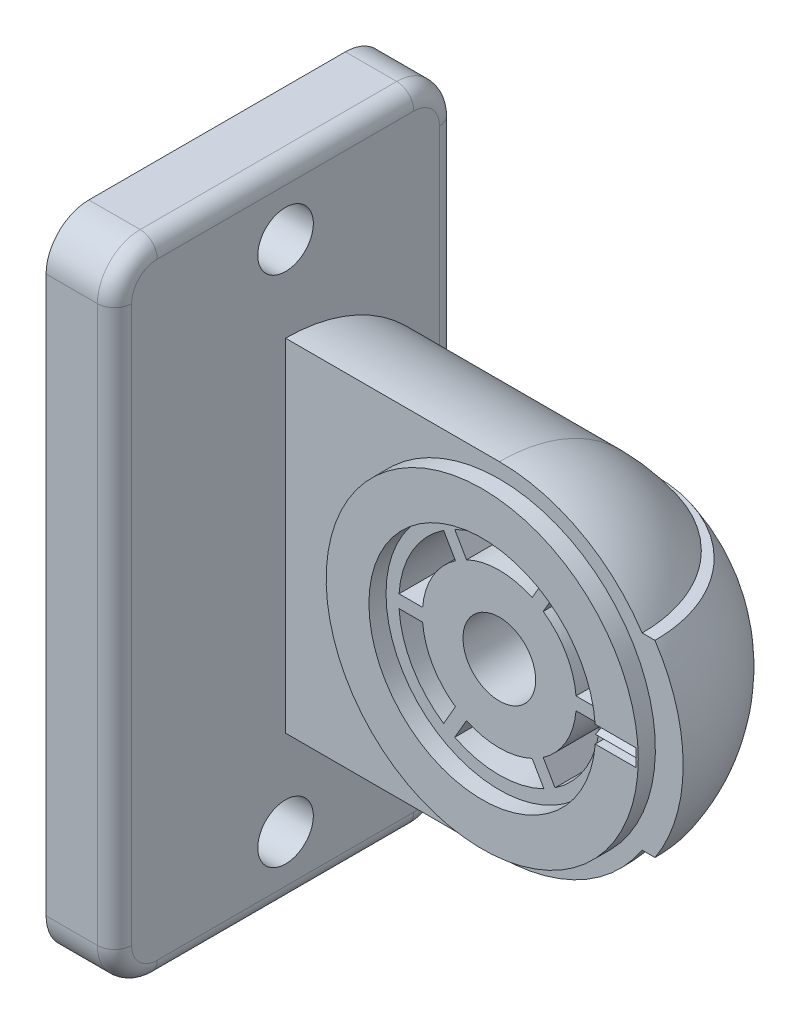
ISO-10303-21;
HEADER;
FILE_DESCRIPTION(('STEP AP214'),'2;1');
FILE_NAME('part.step','',(''),(''),'','','');
FILE_SCHEMA(('AUTOMOTIVE_DESIGN { 1 0 10303 214 1 1 1 1 }'));
ENDSEC;
DATA;
#1=APPLICATION_CONTEXT('core data for automotive mechanical design processes');
#2=APPLICATION_PROTOCOL_DEFINITION('international standard','automotive_design',2000,#1);
#3=PRODUCT_CONTEXT('',#1,'mechanical');
#4=PRODUCT('Part','Part','',(#3));
#5=PRODUCT_RELATED_PRODUCT_CATEGORY('part','',(#4));
#6=PRODUCT_DEFINITION_FORMATION('','',#4);
#7=PRODUCT_DEFINITION_CONTEXT('part definition',#1,'design');
#8=PRODUCT_DEFINITION('design','',#6,#7);
#9=PRODUCT_DEFINITION_SHAPE('','',#8);
#10=(LENGTH_UNIT() NAMED_UNIT(*) SI_UNIT(.MILLI.,.METRE.));
#11=(NAMED_UNIT(*) PLANE_ANGLE_UNIT() SI_UNIT($,.RADIAN.));
#12=(NAMED_UNIT(*) SI_UNIT($,.STERADIAN.) SOLID_ANGLE_UNIT());
#13=UNCERTAINTY_MEASURE_WITH_UNIT(LENGTH_MEASURE(1.E-05),#10,'distance_accuracy_value','');
#14=(GEOMETRIC_REPRESENTATION_CONTEXT(3) GLOBAL_UNCERTAINTY_ASSIGNED_CONTEXT((#13)) GLOBAL_UNIT_ASSIGNED_CONTEXT((#10,
#11,#12)) REPRESENTATION_CONTEXT('',''));
#15=CARTESIAN_POINT('',(0.,0.,0.));
#16=DIRECTION('',(0.,0.,1.));
#17=DIRECTION('',(1.,0.,0.));
#18=AXIS2_PLACEMENT_3D('',#15,#16,#17);
#19=CARTESIAN_POINT('',(8.00000000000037,-35.5000000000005,35.5));
#20=DIRECTION('',(1.,0.,0.));
#21=DIRECTION('',(0.,0.,-1.));
#22=AXIS2_PLACEMENT_3D('',#19,#20,#21);
#23=PLANE('',#22);
#24=CARTESIAN_POINT('',(8.0000000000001,-30.,0.));
#25=DIRECTION('',(-1.,0.,0.));
#26=DIRECTION('',(0.,0.,1.));
#27=AXIS2_PLACEMENT_3D('',#24,#25,#26);
#28=CIRCLE('',#27,3.25);
#29=CARTESIAN_POINT('',(8.00000000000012,-30.,3.24999999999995));
#30=VERTEX_POINT('',#29);
#31=EDGE_CURVE('E424',#30,#30,#28,.T.);
#32=ORIENTED_EDGE('',*,*,#31,.T.);
#33=EDGE_LOOP('',(#32));
#34=FACE_BOUND('',#33,.T.);
#35=CARTESIAN_POINT('',(7.99999999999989,30.,0.));
#36=DIRECTION('',(-1.,0.,0.));
#37=DIRECTION('',(0.,0.,1.));
#38=AXIS2_PLACEMENT_3D('',#35,#36,#37);
#39=CIRCLE('',#38,3.25);
#40=CARTESIAN_POINT('',(7.99999999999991,30.,3.25));
#41=VERTEX_POINT('',#40);
#42=EDGE_CURVE('E423',#41,#41,#39,.T.);
#43=ORIENTED_EDGE('',*,*,#42,.T.);
#44=EDGE_LOOP('',(#43));
#45=FACE_BOUND('',#44,.T.);
#46=DIRECTION('',(0.,1.,0.));
#47=VECTOR('',#46,1.);
#48=CARTESIAN_POINT('',(8.00000000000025,-35.5000000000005,18.));
#49=LINE('',#48,#47);
#50=CARTESIAN_POINT('',(8.,32.5,18.));
#51=VERTEX_POINT('',#50);
#52=CARTESIAN_POINT('',(8.00000000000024,-32.5,18.));
#53=VERTEX_POINT('',#52);
#54=EDGE_CURVE('E754',#51,#53,#49,.F.);
#55=ORIENTED_EDGE('',*,*,#54,.T.);
#56=CARTESIAN_POINT('',(8.00000000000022,-32.5,15.));
#57=DIRECTION('',(1.,0.,0.));
#58=DIRECTION('',(0.,0.,-1.));
#59=AXIS2_PLACEMENT_3D('',#56,#57,#58);
#60=CIRCLE('',#59,3.);
#61=CARTESIAN_POINT('',(8.00000000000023,-35.5,15.));
#62=VERTEX_POINT('',#61);
#63=EDGE_CURVE('E758',#53,#62,#60,.T.);
#64=ORIENTED_EDGE('',*,*,#63,.T.);
#65=DIRECTION('',(0.,0.,-1.));
#66=VECTOR('',#65,1.);
#67=CARTESIAN_POINT('',(8.00000000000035,-35.5,32.5000000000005));
#68=LINE('',#67,#66);
#69=CARTESIAN_POINT('',(8.,-35.5,-15.));
#70=VERTEX_POINT('',#69);
#71=EDGE_CURVE('E723',#62,#70,#68,.T.);
#72=ORIENTED_EDGE('',*,*,#71,.T.);
#73=CARTESIAN_POINT('',(8.,-32.5,-15.));
#74=DIRECTION('',(1.,0.,0.));
#75=DIRECTION('',(0.,0.,-1.));
#76=AXIS2_PLACEMENT_3D('',#73,#74,#75);
#77=CIRCLE('',#76,3.);
#78=CARTESIAN_POINT('',(8.,-32.5,-18.));
#79=VERTEX_POINT('',#78);
#80=EDGE_CURVE('E752',#70,#79,#77,.T.);
#81=ORIENTED_EDGE('',*,*,#80,.T.);
#82=DIRECTION('',(0.,-1.,0.));
#83=VECTOR('',#82,1.);
#84=CARTESIAN_POINT('',(8.,-35.5000000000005,-18.));
#85=LINE('',#84,#83);
#86=CARTESIAN_POINT('',(8.00000000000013,-8.71779788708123,-18.));
#87=VERTEX_POINT('',#86);
#88=EDGE_CURVE('E750',#79,#87,#85,.F.);
#89=ORIENTED_EDGE('',*,*,#88,.T.);
#90=CARTESIAN_POINT('',(8.00000000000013,0.,0.));
#91=DIRECTION('',(-1.,0.,0.));
#92=DIRECTION('',(0.,0.,1.));
#93=AXIS2_PLACEMENT_3D('',#90,#91,#92);
#94=CIRCLE('',#93,20.);
#95=CARTESIAN_POINT('',(8.00000000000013,-20.,0.));
#96=VERTEX_POINT('',#95);
#97=EDGE_CURVE('E719',#87,#96,#94,.T.);
#98=ORIENTED_EDGE('',*,*,#97,.T.);
#99=DIRECTION('',(0.,1.,0.));
#100=VECTOR('',#99,1.);
#101=CARTESIAN_POINT('',(8.,0.,0.));
#102=LINE('',#101,#100);
#103=CARTESIAN_POINT('',(8.,20.,1.37754248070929E-13));
#104=VERTEX_POINT('',#103);
#105=EDGE_CURVE('E706',#96,#104,#102,.T.);
#106=ORIENTED_EDGE('',*,*,#105,.T.);
#107=CARTESIAN_POINT('',(8.00000000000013,8.71779788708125,-18.));
#108=VERTEX_POINT('',#107);
#109=EDGE_CURVE('E720',#104,#108,#94,.T.);
#110=ORIENTED_EDGE('',*,*,#109,.T.);
#111=DIRECTION('',(0.,-1.,0.));
#112=VECTOR('',#111,1.);
#113=CARTESIAN_POINT('',(8.,-35.5000000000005,-18.));
#114=LINE('',#113,#112);
#115=CARTESIAN_POINT('',(7.99999999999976,32.5,-18.));
#116=VERTEX_POINT('',#115);
#117=EDGE_CURVE('E743',#108,#116,#114,.F.);
#118=ORIENTED_EDGE('',*,*,#117,.T.);
#119=CARTESIAN_POINT('',(7.99999999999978,32.5,-15.));
#120=DIRECTION('',(1.,0.,0.));
#121=DIRECTION('',(0.,0.,-1.));
#122=AXIS2_PLACEMENT_3D('',#119,#120,#121);
#123=CIRCLE('',#122,3.);
#124=CARTESIAN_POINT('',(7.99999999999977,35.5,-15.));
#125=VERTEX_POINT('',#124);
#126=EDGE_CURVE('E748',#116,#125,#123,.T.);
#127=ORIENTED_EDGE('',*,*,#126,.T.);
#128=DIRECTION('',(0.,0.,1.));
#129=VECTOR('',#128,1.);
#130=CARTESIAN_POINT('',(7.99999999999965,35.5,-32.5000000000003));
#131=LINE('',#130,#129);
#132=CARTESIAN_POINT('',(8.,35.5,15.));
#133=VERTEX_POINT('',#132);
#134=EDGE_CURVE('E734',#125,#133,#131,.T.);
#135=ORIENTED_EDGE('',*,*,#134,.T.);
#136=CARTESIAN_POINT('',(8.,32.5,15.));
#137=DIRECTION('',(1.,0.,0.));
#138=DIRECTION('',(0.,0.,-1.));
#139=AXIS2_PLACEMENT_3D('',#136,#137,#138);
#140=CIRCLE('',#139,3.);
#141=EDGE_CURVE('E756',#133,#51,#140,.T.);
#142=ORIENTED_EDGE('',*,*,#141,.T.);
#143=EDGE_LOOP('',(#55,#64,#72,#81,#89,#98,#106,#110,#118,#127,#135,#142));
#144=FACE_BOUND('',#143,.T.);
#145=ADVANCED_FACE('F14',(#34,#45,#144),#23,.T.);
#146=CARTESIAN_POINT('',(0.50000000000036,-37.5,32.5));
#147=DIRECTION('',(0.,-1.,0.));
#148=DIRECTION('',(0.,0.,-1.));
#149=AXIS2_PLACEMENT_3D('',#146,#147,#148);
#150=PLANE('',#149);
#151=DIRECTION('',(0.,0.,1.));
#152=VECTOR('',#151,1.);
#153=CARTESIAN_POINT('',(5.99999999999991,-37.5,-32.5));
#154=LINE('',#153,#152);
#155=CARTESIAN_POINT('',(6.,-37.5,-15.));
#156=VERTEX_POINT('',#155);
#157=CARTESIAN_POINT('',(6.00000000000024,-37.5,15.));
#158=VERTEX_POINT('',#157);
#159=EDGE_CURVE('E746',#156,#158,#154,.T.);
#160=ORIENTED_EDGE('',*,*,#159,.T.);
#161=DIRECTION('',(1.,0.,0.));
#162=VECTOR('',#161,1.);
#163=CARTESIAN_POINT('',(0.50000000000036,-37.5,15.));
#164=LINE('',#163,#162);
#165=CARTESIAN_POINT('',(2.34187669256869E-13,-37.5,15.));
#166=VERTEX_POINT('',#165);
#167=EDGE_CURVE('E385',#158,#166,#164,.F.);
#168=ORIENTED_EDGE('',*,*,#167,.T.);
#169=DIRECTION('',(0.,0.,1.));
#170=VECTOR('',#169,1.);
#171=CARTESIAN_POINT('',(0.,-37.5,-15.));
#172=LINE('',#171,#170);
#173=CARTESIAN_POINT('',(0.,-37.5,-15.));
#174=VERTEX_POINT('',#173);
#175=EDGE_CURVE('E389',#174,#166,#172,.T.);
#176=ORIENTED_EDGE('',*,*,#175,.F.);
#177=DIRECTION('',(-1.,0.,0.));
#178=VECTOR('',#177,1.);
#179=CARTESIAN_POINT('',(0.500000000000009,-37.5,-15.));
#180=LINE('',#179,#178);
#181=EDGE_CURVE('E374',#174,#156,#180,.F.);
#182=ORIENTED_EDGE('',*,*,#181,.T.);
#183=EDGE_LOOP('',(#160,#168,#176,#182));
#184=FACE_BOUND('',#183,.T.);
#185=ADVANCED_FACE('F390',(#184),#150,.T.);
#186=CARTESIAN_POINT('',(0.499999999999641,37.5,-32.5));
#187=DIRECTION('',(0.,1.,0.));
#188=DIRECTION('',(0.,0.,1.));
#189=AXIS2_PLACEMENT_3D('',#186,#187,#188);
#190=PLANE('',#189);
#191=DIRECTION('',(1.,0.,0.));
#192=VECTOR('',#191,1.);
#193=CARTESIAN_POINT('',(0.49999999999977,37.5,-15.));
#194=LINE('',#193,#192);
#195=CARTESIAN_POINT('',(5.99999999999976,37.5,-15.));
#196=VERTEX_POINT('',#195);
#197=CARTESIAN_POINT('',(-2.37657116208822E-13,37.5,-15.));
#198=VERTEX_POINT('',#197);
#199=EDGE_CURVE('E911',#196,#198,#194,.F.);
#200=ORIENTED_EDGE('',*,*,#199,.T.);
#201=DIRECTION('',(0.,0.,-1.));
#202=VECTOR('',#201,1.);
#203=CARTESIAN_POINT('',(0.,37.5,15.));
#204=LINE('',#203,#202);
#205=CARTESIAN_POINT('',(0.,37.5,15.));
#206=VERTEX_POINT('',#205);
#207=EDGE_CURVE('E417',#206,#198,#204,.T.);
#208=ORIENTED_EDGE('',*,*,#207,.F.);
#209=DIRECTION('',(-1.,0.,0.));
#210=VECTOR('',#209,1.);
#211=CARTESIAN_POINT('',(0.499999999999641,37.5,15.));
#212=LINE('',#211,#210);
#213=CARTESIAN_POINT('',(6.,37.5,15.));
#214=VERTEX_POINT('',#213);
#215=EDGE_CURVE('E913',#206,#214,#212,.F.);
#216=ORIENTED_EDGE('',*,*,#215,.T.);
#217=DIRECTION('',(0.,0.,-1.));
#218=VECTOR('',#217,1.);
#219=CARTESIAN_POINT('',(6.0000000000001,37.5,32.5));
#220=LINE('',#219,#218);
#221=EDGE_CURVE('E908',#214,#196,#220,.T.);
#222=ORIENTED_EDGE('',*,*,#221,.T.);
#223=EDGE_LOOP('',(#200,#208,#216,#222));
#224=FACE_BOUND('',#223,.T.);
#225=ADVANCED_FACE('F890',(#224),#190,.T.);
#226=CARTESIAN_POINT('',(6.00000000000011,35.5,32.5000000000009));
#227=DIRECTION('',(0.,0.,1.));
#228=DIRECTION('',(1.,0.,0.));
#229=AXIS2_PLACEMENT_3D('',#226,#227,#228);
#230=CYLINDRICAL_SURFACE('',#229,2.);
#231=ORIENTED_EDGE('',*,*,#221,.F.);
#232=CARTESIAN_POINT('',(6.,35.5,15.));
#233=DIRECTION('',(0.,0.,1.));
#234=DIRECTION('',(1.,0.,0.));
#235=AXIS2_PLACEMENT_3D('',#232,#233,#234);
#236=CIRCLE('',#235,2.);
#237=EDGE_CURVE('E765',#214,#133,#236,.F.);
#238=ORIENTED_EDGE('',*,*,#237,.T.);
#239=ORIENTED_EDGE('',*,*,#134,.F.);
#240=CARTESIAN_POINT('',(5.99999999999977,35.5,-15.));
#241=DIRECTION('',(0.,0.,1.));
#242=DIRECTION('',(1.,0.,0.));
#243=AXIS2_PLACEMENT_3D('',#240,#241,#242);
#244=CIRCLE('',#243,2.);
#245=EDGE_CURVE('E762',#125,#196,#244,.T.);
#246=ORIENTED_EDGE('',*,*,#245,.T.);
#247=EDGE_LOOP('',(#231,#238,#239,#246));
#248=FACE_BOUND('',#247,.T.);
#249=ADVANCED_FACE('F1770',(#248),#230,.T.);
#250=CARTESIAN_POINT('',(6.00000000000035,-35.5,32.5000000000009));
#251=DIRECTION('',(0.,0.,-1.));
#252=DIRECTION('',(1.,0.,0.));
#253=AXIS2_PLACEMENT_3D('',#250,#251,#252);
#254=CYLINDRICAL_SURFACE('',#253,2.);
#255=ORIENTED_EDGE('',*,*,#71,.F.);
#256=CARTESIAN_POINT('',(6.00000000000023,-35.5,15.));
#257=DIRECTION('',(0.,0.,-1.));
#258=DIRECTION('',(-1.,0.,0.));
#259=AXIS2_PLACEMENT_3D('',#256,#257,#258);
#260=CIRCLE('',#259,2.);
#261=EDGE_CURVE('E740',#62,#158,#260,.T.);
#262=ORIENTED_EDGE('',*,*,#261,.T.);
#263=ORIENTED_EDGE('',*,*,#159,.F.);
#264=CARTESIAN_POINT('',(6.,-35.5,-15.));
#265=DIRECTION('',(0.,0.,-1.));
#266=DIRECTION('',(-1.,0.,0.));
#267=AXIS2_PLACEMENT_3D('',#264,#265,#266);
#268=CIRCLE('',#267,2.);
#269=EDGE_CURVE('E737',#156,#70,#268,.F.);
#270=ORIENTED_EDGE('',*,*,#269,.T.);
#271=EDGE_LOOP('',(#255,#262,#263,#270));
#272=FACE_BOUND('',#271,.T.);
#273=ADVANCED_FACE('F906',(#272),#254,.T.);
#274=CARTESIAN_POINT('',(33.,0.,2.));
#275=DIRECTION('',(0.,0.,1.));
#276=DIRECTION('',(1.,0.,0.));
#277=AXIS2_PLACEMENT_3D('',#274,#275,#276);
#278=PLANE('',#277);
#279=CARTESIAN_POINT('',(33.,0.,2.));
#280=DIRECTION('',(0.,0.,1.));
#281=DIRECTION('',(1.,0.,0.));
#282=AXIS2_PLACEMENT_3D('',#279,#280,#281);
#283=CIRCLE('',#282,18.25);
#284=CARTESIAN_POINT('',(51.25,0.,2.));
#285=VERTEX_POINT('',#284);
#286=EDGE_CURVE('E467',#285,#285,#283,.T.);
#287=ORIENTED_EDGE('',*,*,#286,.T.);
#288=EDGE_LOOP('',(#287));
#289=FACE_BOUND('',#288,.T.);
#290=DIRECTION('',(0.,1.,0.));
#291=VECTOR('',#290,1.);
#292=CARTESIAN_POINT('',(51.,-1.00000000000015,1.99999999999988));
#293=LINE('',#292,#291);
#294=CARTESIAN_POINT('',(51.,-1.00000000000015,1.99999999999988));
#295=VERTEX_POINT('',#294);
#296=CARTESIAN_POINT('',(51.,1.50133697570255E-13,1.99999999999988));
#297=VERTEX_POINT('',#296);
#298=EDGE_CURVE('E430',#295,#297,#293,.T.);
#299=ORIENTED_EDGE('',*,*,#298,.F.);
#300=DIRECTION('',(1.,0.,0.));
#301=VECTOR('',#300,1.);
#302=CARTESIAN_POINT('',(46.,-1.00000000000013,1.99999999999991));
#303=LINE('',#302,#301);
#304=CARTESIAN_POINT('',(46.2122102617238,-1.00000000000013,1.99999999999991));
#305=VERTEX_POINT('',#304);
#306=EDGE_CURVE('E439',#305,#295,#303,.T.);
#307=ORIENTED_EDGE('',*,*,#306,.F.);
#308=CARTESIAN_POINT('',(33.,0.,2.));
#309=DIRECTION('',(0.,0.,1.));
#310=DIRECTION('',(1.,0.,0.));
#311=AXIS2_PLACEMENT_3D('',#308,#309,#310);
#312=CIRCLE('',#311,13.25);
#313=CARTESIAN_POINT('',(46.2122102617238,1.00000000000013,1.99999999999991));
#314=VERTEX_POINT('',#313);
#315=EDGE_CURVE('E464',#314,#305,#312,.T.);
#316=ORIENTED_EDGE('',*,*,#315,.F.);
#317=DIRECTION('',(1.,0.,0.));
#318=VECTOR('',#317,1.);
#319=CARTESIAN_POINT('',(46.,1.00000000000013,1.99999999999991));
#320=LINE('',#319,#318);
#321=CARTESIAN_POINT('',(51.,1.00000000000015,1.99999999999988));
#322=VERTEX_POINT('',#321);
#323=EDGE_CURVE('E456',#314,#322,#320,.T.);
#324=ORIENTED_EDGE('',*,*,#323,.T.);
#325=DIRECTION('',(0.,-1.,0.));
#326=VECTOR('',#325,1.);
#327=CARTESIAN_POINT('',(51.,1.00000000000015,1.99999999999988));
#328=LINE('',#327,#326);
#329=EDGE_CURVE('E446',#322,#297,#328,.T.);
#330=ORIENTED_EDGE('',*,*,#329,.T.);
#331=EDGE_LOOP('',(#299,#307,#316,#324,#330));
#332=FACE_BOUND('',#331,.T.);
#333=ADVANCED_FACE('F1752',(#289,#332),#278,.T.);
#334=CARTESIAN_POINT('',(33.,0.,2.));
#335=DIRECTION('',(0.,0.,-1.));
#336=DIRECTION('',(-1.,0.,0.));
#337=AXIS2_PLACEMENT_3D('',#334,#335,#336);
#338=CYLINDRICAL_SURFACE('',#337,13.25);
#339=CARTESIAN_POINT('',(33.,0.,0.));
#340=DIRECTION('',(0.,0.,1.));
#341=DIRECTION('',(1.,0.,0.));
#342=AXIS2_PLACEMENT_3D('',#339,#340,#341);
#343=CIRCLE('',#342,13.25);
#344=CARTESIAN_POINT('',(46.2122102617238,-1.00000000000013,1.11660540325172E-13));
#345=VERTEX_POINT('',#344);
#346=CARTESIAN_POINT('',(46.2122102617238,1.00000000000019,0.));
#347=VERTEX_POINT('',#346);
#348=EDGE_CURVE('E459',#345,#347,#343,.T.);
#349=ORIENTED_EDGE('',*,*,#348,.F.);
#350=CARTESIAN_POINT('',(33.,0.,2.00000000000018));
#351=DIRECTION('',(0.,-0.894427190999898,0.447213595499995));
#352=DIRECTION('',(0.,-0.447213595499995,-0.894427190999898));
#353=AXIS2_PLACEMENT_3D('',#350,#351,#352);
#354=ELLIPSE('',#353,29.6279007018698,13.25);
#355=CARTESIAN_POINT('',(46.25,-1.3354916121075E-13,1.99999999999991));
#356=VERTEX_POINT('',#355);
#357=EDGE_CURVE('E442',#345,#356,#354,.T.);
#358=ORIENTED_EDGE('',*,*,#357,.T.);
#359=CARTESIAN_POINT('',(33.,0.,2.00000000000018));
#360=DIRECTION('',(0.,-0.894427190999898,-0.447213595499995));
#361=DIRECTION('',(0.,0.447213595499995,-0.894427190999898));
#362=AXIS2_PLACEMENT_3D('',#359,#360,#361);
#363=ELLIPSE('',#362,29.6279007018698,13.25);
#364=EDGE_CURVE('E969',#347,#356,#363,.T.);
#365=ORIENTED_EDGE('',*,*,#364,.F.);
#366=EDGE_LOOP('',(#349,#358,#365));
#367=FACE_BOUND('',#366,.T.);
#368=ADVANCED_FACE('F1116',(#367),#338,.F.);
#369=ORIENTED_EDGE('',*,*,#315,.T.);
#370=DIRECTION('',(0.,0.,-1.));
#371=VECTOR('',#370,1.);
#372=CARTESIAN_POINT('',(46.2122102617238,-1.00000000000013,2.));
#373=LINE('',#372,#371);
#374=EDGE_CURVE('E975',#305,#345,#373,.T.);
#375=ORIENTED_EDGE('',*,*,#374,.T.);
#376=EDGE_CURVE('E468',#347,#345,#343,.T.);
#377=ORIENTED_EDGE('',*,*,#376,.F.);
#378=DIRECTION('',(0.,0.,-1.));
#379=VECTOR('',#378,1.);
#380=CARTESIAN_POINT('',(46.2122102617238,1.00000000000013,2.));
#381=LINE('',#380,#379);
#382=EDGE_CURVE('E972',#314,#347,#381,.T.);
#383=ORIENTED_EDGE('',*,*,#382,.F.);
#384=EDGE_LOOP('',(#369,#375,#377,#383));
#385=FACE_BOUND('',#384,.T.);
#386=ADVANCED_FACE('F1110',(#385),#338,.F.);
#387=CARTESIAN_POINT('',(33.,0.,0.));
#388=DIRECTION('',(0.,0.,-1.));
#389=DIRECTION('',(1.,0.,0.));
#390=AXIS2_PLACEMENT_3D('',#387,#388,#389);
#391=PLANE('',#390);
#392=ORIENTED_EDGE('',*,*,#376,.T.);
#393=ORIENTED_EDGE('',*,*,#348,.T.);
#394=EDGE_LOOP('',(#392,#393));
#395=FACE_BOUND('',#394,.T.);
#396=CARTESIAN_POINT('',(33.,0.,0.));
#397=DIRECTION('',(0.,0.,1.));
#398=DIRECTION('',(1.,0.,0.));
#399=AXIS2_PLACEMENT_3D('',#396,#397,#398);
#400=CIRCLE('',#399,4.25);
#401=CARTESIAN_POINT('',(37.25,0.,0.));
#402=VERTEX_POINT('',#401);
#403=EDGE_CURVE('E700',#402,#402,#400,.T.);
#404=ORIENTED_EDGE('',*,*,#403,.F.);
#405=EDGE_LOOP('',(#404));
#406=FACE_BOUND('',#405,.T.);
#407=DIRECTION('',(1.,0.,0.));
#408=VECTOR('',#407,1.);
#409=CARTESIAN_POINT('',(41.9686955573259,0.750000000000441,0.));
#410=LINE('',#409,#408);
#411=CARTESIAN_POINT('',(41.9686955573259,0.750000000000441,0.));
#412=VERTEX_POINT('',#411);
#413=CARTESIAN_POINT('',(44.7260393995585,0.750000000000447,0.));
#414=VERTEX_POINT('',#413);
#415=EDGE_CURVE('E649',#412,#414,#410,.T.);
#416=ORIENTED_EDGE('',*,*,#415,.F.);
#417=CARTESIAN_POINT('',(33.,0.,0.));
#418=DIRECTION('',(0.,0.,-1.));
#419=DIRECTION('',(1.,0.,0.));
#420=AXIS2_PLACEMENT_3D('',#417,#418,#419);
#421=CIRCLE('',#420,8.99999999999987);
#422=CARTESIAN_POINT('',(38.1338668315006,7.3921181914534,0.));
#423=VERTEX_POINT('',#422);
#424=EDGE_CURVE('E627',#423,#412,#421,.T.);
#425=ORIENTED_EDGE('',*,*,#424,.F.);
#426=DIRECTION('',(-0.5,-0.866025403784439,0.));
#427=VECTOR('',#426,1.);
#428=CARTESIAN_POINT('',(38.1338668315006,7.3921181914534,0.));
#429=LINE('',#428,#427);
#430=CARTESIAN_POINT('',(39.5125387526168,9.78004800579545,0.));
#431=VERTEX_POINT('',#430);
#432=EDGE_CURVE('E638',#431,#423,#429,.T.);
#433=ORIENTED_EDGE('',*,*,#432,.F.);
#434=CARTESIAN_POINT('',(33.,0.,0.));
#435=DIRECTION('',(0.,0.,1.));
#436=DIRECTION('',(1.,0.,0.));
#437=AXIS2_PLACEMENT_3D('',#434,#435,#436);
#438=CIRCLE('',#437,11.75);
#439=EDGE_CURVE('E652',#414,#431,#438,.T.);
#440=ORIENTED_EDGE('',*,*,#439,.F.);
#441=EDGE_LOOP('',(#416,#425,#433,#440));
#442=FACE_BOUND('',#441,.T.);
#443=DIRECTION('',(0.5,-0.866025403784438,0.));
#444=VECTOR('',#443,1.);
#445=CARTESIAN_POINT('',(29.1651712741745,8.14211819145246,0.));
#446=LINE('',#445,#444);
#447=CARTESIAN_POINT('',(27.7864993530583,10.5300480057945,0.));
#448=VERTEX_POINT('',#447);
#449=CARTESIAN_POINT('',(29.1651712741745,8.14211819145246,0.));
#450=VERTEX_POINT('',#449);
#451=EDGE_CURVE('E489',#448,#450,#446,.T.);
#452=ORIENTED_EDGE('',*,*,#451,.F.);
#453=CARTESIAN_POINT('',(33.,0.,0.));
#454=DIRECTION('',(0.,0.,1.));
#455=DIRECTION('',(1.,0.,0.));
#456=AXIS2_PLACEMENT_3D('',#453,#454,#455);
#457=CIRCLE('',#456,11.75);
#458=CARTESIAN_POINT('',(38.2135006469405,10.5300480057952,0.));
#459=VERTEX_POINT('',#458);
#460=EDGE_CURVE('E473',#459,#448,#457,.T.);
#461=ORIENTED_EDGE('',*,*,#460,.F.);
#462=DIRECTION('',(0.5,0.86602540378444,0.));
#463=VECTOR('',#462,1.);
#464=CARTESIAN_POINT('',(36.8348287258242,8.14211819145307,0.));
#465=LINE('',#464,#463);
#466=CARTESIAN_POINT('',(36.8348287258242,8.14211819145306,0.));
#467=VERTEX_POINT('',#466);
#468=EDGE_CURVE('E478',#467,#459,#465,.T.);
#469=ORIENTED_EDGE('',*,*,#468,.F.);
#470=CARTESIAN_POINT('',(33.,0.,0.));
#471=DIRECTION('',(0.,0.,-1.));
#472=DIRECTION('',(1.,0.,0.));
#473=AXIS2_PLACEMENT_3D('',#470,#471,#472);
#474=CIRCLE('',#473,8.99999999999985);
#475=EDGE_CURVE('E492',#450,#467,#474,.T.);
#476=ORIENTED_EDGE('',*,*,#475,.F.);
#477=EDGE_LOOP('',(#452,#461,#469,#476));
#478=FACE_BOUND('',#477,.T.);
#479=DIRECTION('',(-0.5,0.866025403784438,0.));
#480=VECTOR('',#479,1.);
#481=CARTESIAN_POINT('',(36.8348287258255,-8.1421181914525,0.));
#482=LINE('',#481,#480);
#483=CARTESIAN_POINT('',(38.2135006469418,-10.5300480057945,0.));
#484=VERTEX_POINT('',#483);
#485=CARTESIAN_POINT('',(36.8348287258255,-8.1421181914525,0.));
#486=VERTEX_POINT('',#485);
#487=EDGE_CURVE('E585',#484,#486,#482,.T.);
#488=ORIENTED_EDGE('',*,*,#487,.F.);
#489=CARTESIAN_POINT('',(33.,0.,0.));
#490=DIRECTION('',(0.,0.,1.));
#491=DIRECTION('',(1.,0.,0.));
#492=AXIS2_PLACEMENT_3D('',#489,#490,#491);
#493=CIRCLE('',#492,11.75);
#494=CARTESIAN_POINT('',(27.7864993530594,-10.5300480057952,0.));
#495=VERTEX_POINT('',#494);
#496=EDGE_CURVE('E533',#495,#484,#493,.T.);
#497=ORIENTED_EDGE('',*,*,#496,.F.);
#498=DIRECTION('',(-0.5,-0.86602540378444,0.));
#499=VECTOR('',#498,1.);
#500=CARTESIAN_POINT('',(29.1651712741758,-8.14211819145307,0.));
#501=LINE('',#500,#499);
#502=CARTESIAN_POINT('',(29.1651712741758,-8.14211819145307,0.));
#503=VERTEX_POINT('',#502);
#504=EDGE_CURVE('E574',#503,#495,#501,.T.);
#505=ORIENTED_EDGE('',*,*,#504,.F.);
#506=CARTESIAN_POINT('',(33.,0.,0.));
#507=DIRECTION('',(0.,0.,-1.));
#508=DIRECTION('',(1.,0.,0.));
#509=AXIS2_PLACEMENT_3D('',#506,#507,#508);
#510=CIRCLE('',#509,8.99999999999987);
#511=EDGE_CURVE('E588',#486,#503,#510,.T.);
#512=ORIENTED_EDGE('',*,*,#511,.F.);
#513=EDGE_LOOP('',(#488,#497,#505,#512));
#514=FACE_BOUND('',#513,.T.);
#515=DIRECTION('',(-1.,0.,0.));
#516=VECTOR('',#515,1.);
#517=CARTESIAN_POINT('',(41.968695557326,-0.749999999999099,0.));
#518=LINE('',#517,#516);
#519=CARTESIAN_POINT('',(44.7260393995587,-0.749999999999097,0.));
#520=VERTEX_POINT('',#519);
#521=CARTESIAN_POINT('',(41.968695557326,-0.749999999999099,0.));
#522=VERTEX_POINT('',#521);
#523=EDGE_CURVE('E617',#520,#522,#518,.T.);
#524=ORIENTED_EDGE('',*,*,#523,.F.);
#525=CARTESIAN_POINT('',(33.,0.,0.));
#526=DIRECTION('',(0.,0.,1.));
#527=DIRECTION('',(1.,0.,0.));
#528=AXIS2_PLACEMENT_3D('',#525,#526,#527);
#529=CIRCLE('',#528,11.75);
#530=CARTESIAN_POINT('',(39.512538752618,-9.78004800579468,0.));
#531=VERTEX_POINT('',#530);
#532=EDGE_CURVE('E595',#531,#520,#529,.T.);
#533=ORIENTED_EDGE('',*,*,#532,.F.);
#534=DIRECTION('',(0.500000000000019,-0.866025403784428,0.));
#535=VECTOR('',#534,1.);
#536=CARTESIAN_POINT('',(38.1338668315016,-7.39211819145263,0.));
#537=LINE('',#536,#535);
#538=CARTESIAN_POINT('',(38.1338668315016,-7.39211819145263,0.));
#539=VERTEX_POINT('',#538);
#540=EDGE_CURVE('E606',#539,#531,#537,.T.);
#541=ORIENTED_EDGE('',*,*,#540,.F.);
#542=CARTESIAN_POINT('',(33.,0.,0.));
#543=DIRECTION('',(0.,0.,-1.));
#544=DIRECTION('',(1.,0.,0.));
#545=AXIS2_PLACEMENT_3D('',#542,#543,#544);
#546=CIRCLE('',#545,8.99999999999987);
#547=EDGE_CURVE('E620',#522,#539,#546,.T.);
#548=ORIENTED_EDGE('',*,*,#547,.F.);
#549=EDGE_LOOP('',(#524,#533,#541,#548));
#550=FACE_BOUND('',#549,.T.);
#551=DIRECTION('',(0.5,0.86602540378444,0.));
#552=VECTOR('',#551,1.);
#553=CARTESIAN_POINT('',(27.8661331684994,-7.3921181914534,0.));
#554=LINE('',#553,#552);
#555=CARTESIAN_POINT('',(26.4874612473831,-9.78004800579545,0.));
#556=VERTEX_POINT('',#555);
#557=CARTESIAN_POINT('',(27.8661331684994,-7.3921181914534,0.));
#558=VERTEX_POINT('',#557);
#559=EDGE_CURVE('E522',#556,#558,#554,.T.);
#560=ORIENTED_EDGE('',*,*,#559,.F.);
#561=CARTESIAN_POINT('',(33.,0.,0.));
#562=DIRECTION('',(0.,0.,1.));
#563=DIRECTION('',(1.,0.,0.));
#564=AXIS2_PLACEMENT_3D('',#561,#562,#563);
#565=CIRCLE('',#564,11.75);
#566=CARTESIAN_POINT('',(21.2739606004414,-0.750000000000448,0.));
#567=VERTEX_POINT('',#566);
#568=EDGE_CURVE('E520',#567,#556,#565,.T.);
#569=ORIENTED_EDGE('',*,*,#568,.F.);
#570=DIRECTION('',(-1.,0.,0.));
#571=VECTOR('',#570,1.);
#572=CARTESIAN_POINT('',(24.0313044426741,-0.750000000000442,0.));
#573=LINE('',#572,#571);
#574=CARTESIAN_POINT('',(24.0313044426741,-0.750000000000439,0.));
#575=VERTEX_POINT('',#574);
#576=EDGE_CURVE('E510',#575,#567,#573,.T.);
#577=ORIENTED_EDGE('',*,*,#576,.F.);
#578=CARTESIAN_POINT('',(33.,0.,0.));
#579=DIRECTION('',(0.,0.,-1.));
#580=DIRECTION('',(1.,0.,0.));
#581=AXIS2_PLACEMENT_3D('',#578,#579,#580);
#582=CIRCLE('',#581,8.99999999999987);
#583=EDGE_CURVE('E526',#558,#575,#582,.T.);
#584=ORIENTED_EDGE('',*,*,#583,.F.);
#585=EDGE_LOOP('',(#560,#569,#577,#584));
#586=FACE_BOUND('',#585,.T.);
#587=DIRECTION('',(1.,0.,0.));
#588=VECTOR('',#587,1.);
#589=CARTESIAN_POINT('',(24.031304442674,0.749999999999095,0.));
#590=LINE('',#589,#588);
#591=CARTESIAN_POINT('',(21.2739606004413,0.749999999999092,0.));
#592=VERTEX_POINT('',#591);
#593=CARTESIAN_POINT('',(24.031304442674,0.749999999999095,0.));
#594=VERTEX_POINT('',#593);
#595=EDGE_CURVE('E555',#592,#594,#590,.T.);
#596=ORIENTED_EDGE('',*,*,#595,.F.);
#597=CARTESIAN_POINT('',(33.,0.,0.));
#598=DIRECTION('',(0.,0.,1.));
#599=DIRECTION('',(1.,0.,0.));
#600=AXIS2_PLACEMENT_3D('',#597,#598,#599);
#601=CIRCLE('',#600,11.75);
#602=CARTESIAN_POINT('',(26.487461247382,9.7800480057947,0.));
#603=VERTEX_POINT('',#602);
#604=EDGE_CURVE('E499',#603,#592,#601,.T.);
#605=ORIENTED_EDGE('',*,*,#604,.F.);
#606=DIRECTION('',(-0.5,0.866025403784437,0.));
#607=VECTOR('',#606,1.);
#608=CARTESIAN_POINT('',(27.8661331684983,7.39211819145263,0.));
#609=LINE('',#608,#607);
#610=CARTESIAN_POINT('',(27.8661331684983,7.39211819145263,0.));
#611=VERTEX_POINT('',#610);
#612=EDGE_CURVE('E544',#611,#603,#609,.T.);
#613=ORIENTED_EDGE('',*,*,#612,.F.);
#614=CARTESIAN_POINT('',(33.,0.,0.));
#615=DIRECTION('',(0.,0.,-1.));
#616=DIRECTION('',(1.,0.,0.));
#617=AXIS2_PLACEMENT_3D('',#614,#615,#616);
#618=CIRCLE('',#617,8.99999999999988);
#619=EDGE_CURVE('E558',#594,#611,#618,.T.);
#620=ORIENTED_EDGE('',*,*,#619,.F.);
#621=EDGE_LOOP('',(#596,#605,#613,#620));
#622=FACE_BOUND('',#621,.T.);
#623=ADVANCED_FACE('F859',(#395,#406,#442,#478,#514,#550,#586,#622),#391,.F.);
#624=CARTESIAN_POINT('',(54.5,0.,0.));
#625=DIRECTION('',(-1.,0.,0.));
#626=DIRECTION('',(0.,0.,1.));
#627=AXIS2_PLACEMENT_3D('',#624,#625,#626);
#628=CYLINDRICAL_SURFACE('',#627,20.);
#629=DIRECTION('',(-1.,0.,0.));
#630=VECTOR('',#629,1.);
#631=CARTESIAN_POINT('',(54.5,6.75,-18.8265105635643));
#632=LINE('',#631,#630);
#633=CARTESIAN_POINT('',(29.1028856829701,6.75,-18.8265105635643));
#634=VERTEX_POINT('',#633);
#635=CARTESIAN_POINT('',(34.5,6.75,-18.8265105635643));
#636=VERTEX_POINT('',#635);
#637=EDGE_CURVE('E698',#634,#636,#632,.F.);
#638=ORIENTED_EDGE('',*,*,#637,.F.);
#639=CARTESIAN_POINT('',(25.20577136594,0.,0.));
#640=DIRECTION('',(-0.866025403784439,0.5,0.));
#641=DIRECTION('',(-0.5,-0.866025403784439,0.));
#642=AXIS2_PLACEMENT_3D('',#639,#640,#641);
#643=ELLIPSE('',#642,23.0940107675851,20.);
#644=CARTESIAN_POINT('',(25.20577136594,0.,-20.));
#645=VERTEX_POINT('',#644);
#646=EDGE_CURVE('E964',#645,#634,#643,.F.);
#647=ORIENTED_EDGE('',*,*,#646,.F.);
#648=CARTESIAN_POINT('',(25.20577136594,0.,0.));
#649=DIRECTION('',(-0.866025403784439,-0.5,0.));
#650=DIRECTION('',(-0.5,0.866025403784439,0.));
#651=AXIS2_PLACEMENT_3D('',#648,#649,#650);
#652=ELLIPSE('',#651,23.0940107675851,20.);
#653=CARTESIAN_POINT('',(29.1028856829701,-6.75,-18.8265105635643));
#654=VERTEX_POINT('',#653);
#655=EDGE_CURVE('E962',#654,#645,#652,.F.);
#656=ORIENTED_EDGE('',*,*,#655,.F.);
#657=DIRECTION('',(-1.,0.,0.));
#658=VECTOR('',#657,1.);
#659=CARTESIAN_POINT('',(54.5,-6.75,-18.8265105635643));
#660=LINE('',#659,#658);
#661=CARTESIAN_POINT('',(34.5,-6.75,-18.8265105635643));
#662=VERTEX_POINT('',#661);
#663=EDGE_CURVE('E696',#662,#654,#660,.T.);
#664=ORIENTED_EDGE('',*,*,#663,.F.);
#665=CARTESIAN_POINT('',(34.5,0.,0.));
#666=DIRECTION('',(-1.,0.,0.));
#667=DIRECTION('',(0.,0.,1.));
#668=AXIS2_PLACEMENT_3D('',#665,#666,#667);
#669=CIRCLE('',#668,20.);
#670=CARTESIAN_POINT('',(34.5,-11.,-16.7032930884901));
#671=VERTEX_POINT('',#670);
#672=EDGE_CURVE('E941',#662,#671,#669,.T.);
#673=ORIENTED_EDGE('',*,*,#672,.T.);
#674=DIRECTION('',(-1.,0.,0.));
#675=VECTOR('',#674,1.);
#676=CARTESIAN_POINT('',(54.5,-11.,-16.7032930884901));
#677=LINE('',#676,#675);
#678=CARTESIAN_POINT('',(33.,-11.,-16.7032930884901));
#679=VERTEX_POINT('',#678);
#680=EDGE_CURVE('E924',#679,#671,#677,.F.);
#681=ORIENTED_EDGE('',*,*,#680,.F.);
#682=CARTESIAN_POINT('',(33.,0.,0.));
#683=DIRECTION('',(-1.,0.,0.));
#684=DIRECTION('',(0.,0.,1.));
#685=AXIS2_PLACEMENT_3D('',#682,#683,#684);
#686=CIRCLE('',#685,20.);
#687=CARTESIAN_POINT('',(33.,-20.,0.));
#688=VERTEX_POINT('',#687);
#689=EDGE_CURVE('E715',#679,#688,#686,.T.);
#690=ORIENTED_EDGE('',*,*,#689,.T.);
#691=DIRECTION('',(1.,0.,0.));
#692=VECTOR('',#691,1.);
#693=CARTESIAN_POINT('',(8.00000000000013,-20.,0.));
#694=LINE('',#693,#692);
#695=EDGE_CURVE('E703',#96,#688,#694,.T.);
#696=ORIENTED_EDGE('',*,*,#695,.F.);
#697=ORIENTED_EDGE('',*,*,#97,.F.);
#698=CARTESIAN_POINT('',(7.99999999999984,0.,-20.));
#699=VERTEX_POINT('',#698);
#700=EDGE_CURVE('E725',#699,#87,#94,.T.);
#701=ORIENTED_EDGE('',*,*,#700,.F.);
#702=EDGE_CURVE('E724',#108,#699,#94,.T.);
#703=ORIENTED_EDGE('',*,*,#702,.F.);
#704=ORIENTED_EDGE('',*,*,#109,.F.);
#705=DIRECTION('',(1.,0.,0.));
#706=VECTOR('',#705,1.);
#707=CARTESIAN_POINT('',(8.00000000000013,20.,1.39659253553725E-13));
#708=LINE('',#707,#706);
#709=CARTESIAN_POINT('',(33.,20.,1.39659253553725E-13));
#710=VERTEX_POINT('',#709);
#711=EDGE_CURVE('E709',#104,#710,#708,.T.);
#712=ORIENTED_EDGE('',*,*,#711,.T.);
#713=CARTESIAN_POINT('',(33.,11.,-16.70329308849));
#714=VERTEX_POINT('',#713);
#715=EDGE_CURVE('E716',#710,#714,#686,.T.);
#716=ORIENTED_EDGE('',*,*,#715,.T.);
#717=DIRECTION('',(-1.,0.,0.));
#718=VECTOR('',#717,1.);
#719=CARTESIAN_POINT('',(54.5,11.,-16.7032930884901));
#720=LINE('',#719,#718);
#721=CARTESIAN_POINT('',(34.5,11.,-16.7032930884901));
#722=VERTEX_POINT('',#721);
#723=EDGE_CURVE('E932',#722,#714,#720,.T.);
#724=ORIENTED_EDGE('',*,*,#723,.F.);
#725=EDGE_CURVE('E942',#722,#636,#669,.T.);
#726=ORIENTED_EDGE('',*,*,#725,.T.);
#727=EDGE_LOOP('',(#638,#647,#656,#664,#673,#681,#690,#696,#697,#701,#703,#704,#712,#716,#724,#726));
#728=FACE_BOUND('',#727,.T.);
#729=ADVANCED_FACE('F853',(#728),#628,.T.);
#730=CARTESIAN_POINT('',(34.5,0.,0.));
#731=DIRECTION('',(-1.,0.,0.));
#732=DIRECTION('',(0.,1.,0.));
#733=AXIS2_PLACEMENT_3D('',#730,#731,#732);
#734=SPHERICAL_SURFACE('',#733,20.);
#735=CARTESIAN_POINT('',(34.5,6.75,0.));
#736=DIRECTION('',(0.,1.,0.));
#737=DIRECTION('',(0.,0.,1.));
#738=AXIS2_PLACEMENT_3D('',#735,#736,#737);
#739=CIRCLE('',#738,18.8265105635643);
#740=CARTESIAN_POINT('',(36.8971143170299,6.75,-18.6732788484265));
#741=VERTEX_POINT('',#740);
#742=EDGE_CURVE('E960',#636,#741,#739,.F.);
#743=ORIENTED_EDGE('',*,*,#742,.F.);
#744=ORIENTED_EDGE('',*,*,#725,.F.);
#745=CARTESIAN_POINT('',(34.5,11.,0.));
#746=DIRECTION('',(0.,-1.,0.));
#747=DIRECTION('',(0.,0.,-1.));
#748=AXIS2_PLACEMENT_3D('',#745,#746,#747);
#749=CIRCLE('',#748,16.7032930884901);
#750=CARTESIAN_POINT('',(51.2032930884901,11.,0.));
#751=VERTEX_POINT('',#750);
#752=EDGE_CURVE('E930',#751,#722,#749,.F.);
#753=ORIENTED_EDGE('',*,*,#752,.F.);
#754=CARTESIAN_POINT('',(34.5,0.,0.));
#755=DIRECTION('',(0.,0.,-1.));
#756=DIRECTION('',(1.,0.,0.));
#757=AXIS2_PLACEMENT_3D('',#754,#755,#756);
#758=CIRCLE('',#757,20.);
#759=CARTESIAN_POINT('',(51.2032930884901,-11.,0.));
#760=VERTEX_POINT('',#759);
#761=EDGE_CURVE('E938',#751,#760,#758,.T.);
#762=ORIENTED_EDGE('',*,*,#761,.T.);
#763=CARTESIAN_POINT('',(34.5,-11.,0.));
#764=DIRECTION('',(0.,1.,0.));
#765=DIRECTION('',(0.,0.,1.));
#766=AXIS2_PLACEMENT_3D('',#763,#764,#765);
#767=CIRCLE('',#766,16.70329308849);
#768=EDGE_CURVE('E918',#671,#760,#767,.F.);
#769=ORIENTED_EDGE('',*,*,#768,.F.);
#770=ORIENTED_EDGE('',*,*,#672,.F.);
#771=CARTESIAN_POINT('',(34.5,-6.75,0.));
#772=DIRECTION('',(0.,-1.,0.));
#773=DIRECTION('',(1.,0.,0.));
#774=AXIS2_PLACEMENT_3D('',#771,#772,#773);
#775=CIRCLE('',#774,18.8265105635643);
#776=CARTESIAN_POINT('',(36.89711431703,-6.75,-18.6732788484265));
#777=VERTEX_POINT('',#776);
#778=EDGE_CURVE('E951',#777,#662,#775,.F.);
#779=ORIENTED_EDGE('',*,*,#778,.F.);
#780=CARTESIAN_POINT('',(39.2206714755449,-2.72548094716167,0.));
#781=DIRECTION('',(0.866025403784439,-0.5,0.));
#782=DIRECTION('',(0.5,0.866025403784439,0.));
#783=AXIS2_PLACEMENT_3D('',#780,#781,#782);
#784=CIRCLE('',#783,19.242843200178);
#785=CARTESIAN_POINT('',(40.79422863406,0.,-18.9837479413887));
#786=VERTEX_POINT('',#785);
#787=EDGE_CURVE('E955',#786,#777,#784,.F.);
#788=ORIENTED_EDGE('',*,*,#787,.F.);
#789=CARTESIAN_POINT('',(39.2206714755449,2.72548094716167,0.));
#790=DIRECTION('',(0.866025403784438,0.5,0.));
#791=DIRECTION('',(-0.5,0.866025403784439,0.));
#792=AXIS2_PLACEMENT_3D('',#789,#790,#791);
#793=CIRCLE('',#792,19.242843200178);
#794=EDGE_CURVE('E958',#741,#786,#793,.F.);
#795=ORIENTED_EDGE('',*,*,#794,.F.);
#796=EDGE_LOOP('',(#743,#744,#753,#762,#769,#770,#779,#788,#795));
#797=FACE_BOUND('',#796,.T.);
#798=ADVANCED_FACE('F858',(#797),#734,.T.);
#799=CARTESIAN_POINT('',(33.,0.,0.));
#800=DIRECTION('',(0.,0.,-1.));
#801=DIRECTION('',(0.,1.,0.));
#802=AXIS2_PLACEMENT_3D('',#799,#800,#801);
#803=CIRCLE('',#802,18.25);
#804=CARTESIAN_POINT('',(33.,18.25,1.27439068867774E-13));
#805=VERTEX_POINT('',#804);
#806=EDGE_CURVE('E966',#805,#805,#803,.F.);
#807=ORIENTED_EDGE('',*,*,#806,.F.);
#808=EDGE_LOOP('',(#807));
#809=FACE_BOUND('',#808,.T.);
#810=ORIENTED_EDGE('',*,*,#761,.F.);
#811=DIRECTION('',(-1.,0.,0.));
#812=VECTOR('',#811,1.);
#813=CARTESIAN_POINT('',(33.,11.,0.));
#814=LINE('',#813,#812);
#815=CARTESIAN_POINT('',(49.7032930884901,11.,0.));
#816=VERTEX_POINT('',#815);
#817=EDGE_CURVE('E948',#751,#816,#814,.T.);
#818=ORIENTED_EDGE('',*,*,#817,.T.);
#819=CARTESIAN_POINT('',(33.,0.,0.));
#820=DIRECTION('',(0.,0.,-1.));
#821=DIRECTION('',(1.,0.,0.));
#822=AXIS2_PLACEMENT_3D('',#819,#820,#821);
#823=CIRCLE('',#822,20.);
#824=EDGE_CURVE('E713',#710,#816,#823,.T.);
#825=ORIENTED_EDGE('',*,*,#824,.F.);
#826=ORIENTED_EDGE('',*,*,#711,.F.);
#827=ORIENTED_EDGE('',*,*,#105,.F.);
#828=ORIENTED_EDGE('',*,*,#695,.T.);
#829=CARTESIAN_POINT('',(49.7032930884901,-11.,0.));
#830=VERTEX_POINT('',#829);
#831=EDGE_CURVE('E712',#830,#688,#823,.T.);
#832=ORIENTED_EDGE('',*,*,#831,.F.);
#833=DIRECTION('',(1.,0.,0.));
#834=VECTOR('',#833,1.);
#835=CARTESIAN_POINT('',(33.,-11.,0.));
#836=LINE('',#835,#834);
#837=EDGE_CURVE('E945',#830,#760,#836,.T.);
#838=ORIENTED_EDGE('',*,*,#837,.T.);
#839=EDGE_LOOP('',(#810,#818,#825,#826,#827,#828,#832,#838));
#840=FACE_BOUND('',#839,.T.);
#841=ADVANCED_FACE('F1014',(#809,#840),#391,.F.);
#842=CARTESIAN_POINT('',(26.7611252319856,-11.,-37.5));
#843=DIRECTION('',(0.,1.,0.));
#844=DIRECTION('',(0.,0.,1.));
#845=AXIS2_PLACEMENT_3D('',#842,#843,#844);
#846=PLANE('',#845);
#847=CARTESIAN_POINT('',(33.,-11.,0.));
#848=DIRECTION('',(0.,1.,0.));
#849=DIRECTION('',(0.,0.,1.));
#850=AXIS2_PLACEMENT_3D('',#847,#848,#849);
#851=CIRCLE('',#850,16.70329308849);
#852=EDGE_CURVE('E927',#830,#679,#851,.T.);
#853=ORIENTED_EDGE('',*,*,#852,.T.);
#854=ORIENTED_EDGE('',*,*,#680,.T.);
#855=ORIENTED_EDGE('',*,*,#768,.T.);
#856=ORIENTED_EDGE('',*,*,#837,.F.);
#857=EDGE_LOOP('',(#853,#854,#855,#856));
#858=FACE_BOUND('',#857,.T.);
#859=ADVANCED_FACE('F1029',(#858),#846,.F.);
#860=CARTESIAN_POINT('',(26.7611252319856,11.,-37.5));
#861=DIRECTION('',(0.,-1.,0.));
#862=DIRECTION('',(0.,0.,-1.));
#863=AXIS2_PLACEMENT_3D('',#860,#861,#862);
#864=PLANE('',#863);
#865=CARTESIAN_POINT('',(33.,11.,0.));
#866=DIRECTION('',(0.,-1.,0.));
#867=DIRECTION('',(0.,0.,-1.));
#868=AXIS2_PLACEMENT_3D('',#865,#866,#867);
#869=CIRCLE('',#868,16.7032930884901);
#870=EDGE_CURVE('E935',#714,#816,#869,.T.);
#871=ORIENTED_EDGE('',*,*,#870,.T.);
#872=ORIENTED_EDGE('',*,*,#817,.F.);
#873=ORIENTED_EDGE('',*,*,#752,.T.);
#874=ORIENTED_EDGE('',*,*,#723,.T.);
#875=EDGE_LOOP('',(#871,#872,#873,#874));
#876=FACE_BOUND('',#875,.T.);
#877=ADVANCED_FACE('F1021',(#876),#864,.F.);
#878=CARTESIAN_POINT('',(33.,0.,0.));
#879=DIRECTION('',(-1.,0.,0.));
#880=DIRECTION('',(0.,1.,0.));
#881=AXIS2_PLACEMENT_3D('',#878,#879,#880);
#882=SPHERICAL_SURFACE('',#881,20.);
#883=ORIENTED_EDGE('',*,*,#870,.F.);
#884=ORIENTED_EDGE('',*,*,#715,.F.);
#885=ORIENTED_EDGE('',*,*,#824,.T.);
#886=EDGE_LOOP('',(#883,#884,#885));
#887=FACE_BOUND('',#886,.T.);
#888=ADVANCED_FACE('F1086',(#887),#882,.T.);
#889=ORIENTED_EDGE('',*,*,#852,.F.);
#890=ORIENTED_EDGE('',*,*,#831,.T.);
#891=ORIENTED_EDGE('',*,*,#689,.F.);
#892=EDGE_LOOP('',(#889,#890,#891));
#893=FACE_BOUND('',#892,.T.);
#894=ADVANCED_FACE('F1084',(#893),#882,.T.);
#895=CARTESIAN_POINT('',(33.,0.,-37.5));
#896=DIRECTION('',(0.,0.,1.));
#897=DIRECTION('',(1.,0.,0.));
#898=AXIS2_PLACEMENT_3D('',#895,#896,#897);
#899=CYLINDRICAL_SURFACE('',#898,4.25);
#900=CARTESIAN_POINT('',(33.,0.,-8.));
#901=DIRECTION('',(0.,0.,1.));
#902=DIRECTION('',(1.,0.,0.));
#903=AXIS2_PLACEMENT_3D('',#900,#901,#902);
#904=CIRCLE('',#903,4.25);
#905=CARTESIAN_POINT('',(37.25,0.,-8.));
#906=VERTEX_POINT('',#905);
#907=EDGE_CURVE('E686',#906,#906,#904,.F.);
#908=ORIENTED_EDGE('',*,*,#907,.T.);
#909=EDGE_LOOP('',(#908));
#910=FACE_BOUND('',#909,.T.);
#911=ORIENTED_EDGE('',*,*,#403,.T.);
#912=EDGE_LOOP('',(#911));
#913=FACE_BOUND('',#912,.T.);
#914=ADVANCED_FACE('F1082',(#910,#913),#899,.F.);
#915=CARTESIAN_POINT('',(8.,0.,-8.));
#916=DIRECTION('',(0.,0.,1.));
#917=DIRECTION('',(1.,0.,0.));
#918=AXIS2_PLACEMENT_3D('',#915,#916,#917);
#919=PLANE('',#918);
#920=DIRECTION('',(-0.5,-0.866025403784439,0.));
#921=VECTOR('',#920,1.);
#922=CARTESIAN_POINT('',(29.1028856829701,6.75,-8.));
#923=LINE('',#922,#921);
#924=CARTESIAN_POINT('',(29.1028856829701,6.75,-8.));
#925=VERTEX_POINT('',#924);
#926=CARTESIAN_POINT('',(25.20577136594,0.,-8.));
#927=VERTEX_POINT('',#926);
#928=EDGE_CURVE('E659',#925,#927,#923,.T.);
#929=ORIENTED_EDGE('',*,*,#928,.F.);
#930=DIRECTION('',(-1.,0.,0.));
#931=VECTOR('',#930,1.);
#932=CARTESIAN_POINT('',(36.8971143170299,6.75,-8.));
#933=LINE('',#932,#931);
#934=CARTESIAN_POINT('',(36.8971143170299,6.75,-8.));
#935=VERTEX_POINT('',#934);
#936=EDGE_CURVE('E680',#935,#925,#933,.T.);
#937=ORIENTED_EDGE('',*,*,#936,.F.);
#938=DIRECTION('',(-0.5,0.866025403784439,0.));
#939=VECTOR('',#938,1.);
#940=CARTESIAN_POINT('',(40.79422863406,0.,-8.));
#941=LINE('',#940,#939);
#942=CARTESIAN_POINT('',(40.79422863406,0.,-8.));
#943=VERTEX_POINT('',#942);
#944=EDGE_CURVE('E677',#943,#935,#941,.T.);
#945=ORIENTED_EDGE('',*,*,#944,.F.);
#946=DIRECTION('',(0.5,0.866025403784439,0.));
#947=VECTOR('',#946,1.);
#948=CARTESIAN_POINT('',(36.89711431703,-6.75,-8.));
#949=LINE('',#948,#947);
#950=CARTESIAN_POINT('',(36.89711431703,-6.75,-8.));
#951=VERTEX_POINT('',#950);
#952=EDGE_CURVE('E674',#951,#943,#949,.T.);
#953=ORIENTED_EDGE('',*,*,#952,.F.);
#954=DIRECTION('',(1.,0.,0.));
#955=VECTOR('',#954,1.);
#956=CARTESIAN_POINT('',(29.1028856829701,-6.75,-8.));
#957=LINE('',#956,#955);
#958=CARTESIAN_POINT('',(29.1028856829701,-6.75,-8.));
#959=VERTEX_POINT('',#958);
#960=EDGE_CURVE('E671',#959,#951,#957,.T.);
#961=ORIENTED_EDGE('',*,*,#960,.F.);
#962=DIRECTION('',(0.5,-0.866025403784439,0.));
#963=VECTOR('',#962,1.);
#964=CARTESIAN_POINT('',(25.20577136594,0.,-8.));
#965=LINE('',#964,#963);
#966=EDGE_CURVE('E668',#927,#959,#965,.T.);
#967=ORIENTED_EDGE('',*,*,#966,.F.);
#968=EDGE_LOOP('',(#929,#937,#945,#953,#961,#967));
#969=FACE_BOUND('',#968,.T.);
#970=ORIENTED_EDGE('',*,*,#907,.F.);
#971=EDGE_LOOP('',(#970));
#972=FACE_BOUND('',#971,.T.);
#973=ADVANCED_FACE('F1047',(#969,#972),#919,.F.);
#974=CARTESIAN_POINT('',(29.1028856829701,6.75,-37.5));
#975=DIRECTION('',(-0.866025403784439,0.5,0.));
#976=DIRECTION('',(-0.5,-0.866025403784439,0.));
#977=AXIS2_PLACEMENT_3D('',#974,#975,#976);
#978=PLANE('',#977);
#979=ORIENTED_EDGE('',*,*,#646,.T.);
#980=DIRECTION('',(0.,0.,1.));
#981=VECTOR('',#980,1.);
#982=CARTESIAN_POINT('',(29.1028856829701,6.75,-37.5));
#983=LINE('',#982,#981);
#984=EDGE_CURVE('E684',#634,#925,#983,.T.);
#985=ORIENTED_EDGE('',*,*,#984,.T.);
#986=ORIENTED_EDGE('',*,*,#928,.T.);
#987=DIRECTION('',(0.,0.,1.));
#988=VECTOR('',#987,1.);
#989=CARTESIAN_POINT('',(25.20577136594,0.,-37.5));
#990=LINE('',#989,#988);
#991=EDGE_CURVE('E683',#645,#927,#990,.T.);
#992=ORIENTED_EDGE('',*,*,#991,.F.);
#993=EDGE_LOOP('',(#979,#985,#986,#992));
#994=FACE_BOUND('',#993,.T.);
#995=ADVANCED_FACE('F1052',(#994),#978,.F.);
#996=CARTESIAN_POINT('',(36.8971143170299,6.75,-37.5));
#997=DIRECTION('',(0.,1.,0.));
#998=DIRECTION('',(0.,0.,1.));
#999=AXIS2_PLACEMENT_3D('',#996,#997,#998);
#1000=PLANE('',#999);
#1001=ORIENTED_EDGE('',*,*,#637,.T.);
#1002=ORIENTED_EDGE('',*,*,#742,.T.);
#1003=DIRECTION('',(0.,0.,1.));
#1004=VECTOR('',#1003,1.);
#1005=CARTESIAN_POINT('',(36.8971143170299,6.75,-37.5));
#1006=LINE('',#1005,#1004);
#1007=EDGE_CURVE('E687',#741,#935,#1006,.T.);
#1008=ORIENTED_EDGE('',*,*,#1007,.T.);
#1009=ORIENTED_EDGE('',*,*,#936,.T.);
#1010=ORIENTED_EDGE('',*,*,#984,.F.);
#1011=EDGE_LOOP('',(#1001,#1002,#1008,#1009,#1010));
#1012=FACE_BOUND('',#1011,.T.);
#1013=ADVANCED_FACE('F1055',(#1012),#1000,.F.);
#1014=CARTESIAN_POINT('',(40.79422863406,0.,-37.5));
#1015=DIRECTION('',(0.866025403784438,0.5,0.));
#1016=DIRECTION('',(-0.5,0.866025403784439,0.));
#1017=AXIS2_PLACEMENT_3D('',#1014,#1015,#1016);
#1018=PLANE('',#1017);
#1019=ORIENTED_EDGE('',*,*,#794,.T.);
#1020=DIRECTION('',(0.,0.,1.));
#1021=VECTOR('',#1020,1.);
#1022=CARTESIAN_POINT('',(40.79422863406,0.,-37.5));
#1023=LINE('',#1022,#1021);
#1024=EDGE_CURVE('E689',#786,#943,#1023,.T.);
#1025=ORIENTED_EDGE('',*,*,#1024,.T.);
#1026=ORIENTED_EDGE('',*,*,#944,.T.);
#1027=ORIENTED_EDGE('',*,*,#1007,.F.);
#1028=EDGE_LOOP('',(#1019,#1025,#1026,#1027));
#1029=FACE_BOUND('',#1028,.T.);
#1030=ADVANCED_FACE('F1063',(#1029),#1018,.F.);
#1031=CARTESIAN_POINT('',(36.89711431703,-6.75,-37.5));
#1032=DIRECTION('',(0.866025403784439,-0.5,0.));
#1033=DIRECTION('',(0.5,0.866025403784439,0.));
#1034=AXIS2_PLACEMENT_3D('',#1031,#1032,#1033);
#1035=PLANE('',#1034);
#1036=ORIENTED_EDGE('',*,*,#787,.T.);
#1037=DIRECTION('',(0.,0.,1.));
#1038=VECTOR('',#1037,1.);
#1039=CARTESIAN_POINT('',(36.89711431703,-6.75,-37.5));
#1040=LINE('',#1039,#1038);
#1041=EDGE_CURVE('E691',#777,#951,#1040,.T.);
#1042=ORIENTED_EDGE('',*,*,#1041,.T.);
#1043=ORIENTED_EDGE('',*,*,#952,.T.);
#1044=ORIENTED_EDGE('',*,*,#1024,.F.);
#1045=EDGE_LOOP('',(#1036,#1042,#1043,#1044));
#1046=FACE_BOUND('',#1045,.T.);
#1047=ADVANCED_FACE('F1061',(#1046),#1035,.F.);
#1048=CARTESIAN_POINT('',(29.1028856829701,-6.75,-37.5));
#1049=DIRECTION('',(0.,-1.,0.));
#1050=DIRECTION('',(1.,0.,0.));
#1051=AXIS2_PLACEMENT_3D('',#1048,#1049,#1050);
#1052=PLANE('',#1051);
#1053=ORIENTED_EDGE('',*,*,#663,.T.);
#1054=DIRECTION('',(0.,0.,1.));
#1055=VECTOR('',#1054,1.);
#1056=CARTESIAN_POINT('',(29.1028856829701,-6.75,-37.5));
#1057=LINE('',#1056,#1055);
#1058=EDGE_CURVE('E693',#654,#959,#1057,.T.);
#1059=ORIENTED_EDGE('',*,*,#1058,.T.);
#1060=ORIENTED_EDGE('',*,*,#960,.T.);
#1061=ORIENTED_EDGE('',*,*,#1041,.F.);
#1062=ORIENTED_EDGE('',*,*,#778,.T.);
#1063=EDGE_LOOP('',(#1053,#1059,#1060,#1061,#1062));
#1064=FACE_BOUND('',#1063,.T.);
#1065=ADVANCED_FACE('F1039',(#1064),#1052,.F.);
#1066=CARTESIAN_POINT('',(25.20577136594,0.,-37.5));
#1067=DIRECTION('',(-0.866025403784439,-0.5,0.));
#1068=DIRECTION('',(0.5,-0.866025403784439,0.));
#1069=AXIS2_PLACEMENT_3D('',#1066,#1067,#1068);
#1070=PLANE('',#1069);
#1071=ORIENTED_EDGE('',*,*,#655,.T.);
#1072=ORIENTED_EDGE('',*,*,#991,.T.);
#1073=ORIENTED_EDGE('',*,*,#966,.T.);
#1074=ORIENTED_EDGE('',*,*,#1058,.F.);
#1075=EDGE_LOOP('',(#1071,#1072,#1073,#1074));
#1076=FACE_BOUND('',#1075,.T.);
#1077=ADVANCED_FACE('F1042',(#1076),#1070,.F.);
#1078=CARTESIAN_POINT('',(33.,0.,-10.));
#1079=DIRECTION('',(0.,0.,1.));
#1080=DIRECTION('',(1.,0.,0.));
#1081=AXIS2_PLACEMENT_3D('',#1078,#1079,#1080);
#1082=CYLINDRICAL_SURFACE('',#1081,8.99999999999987);
#1083=ORIENTED_EDGE('',*,*,#424,.T.);
#1084=DIRECTION('',(0.,0.,1.));
#1085=VECTOR('',#1084,1.);
#1086=CARTESIAN_POINT('',(41.9686955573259,0.750000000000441,-10.));
#1087=LINE('',#1086,#1085);
#1088=CARTESIAN_POINT('',(41.9686955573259,0.750000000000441,-10.));
#1089=VERTEX_POINT('',#1088);
#1090=EDGE_CURVE('E647',#1089,#412,#1087,.T.);
#1091=ORIENTED_EDGE('',*,*,#1090,.F.);
#1092=CARTESIAN_POINT('',(33.,0.,-10.));
#1093=DIRECTION('',(0.,0.,-1.));
#1094=DIRECTION('',(1.,0.,0.));
#1095=AXIS2_PLACEMENT_3D('',#1092,#1093,#1094);
#1096=CIRCLE('',#1095,8.99999999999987);
#1097=CARTESIAN_POINT('',(38.1338668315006,7.3921181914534,-10.));
#1098=VERTEX_POINT('',#1097);
#1099=EDGE_CURVE('E634',#1098,#1089,#1096,.T.);
#1100=ORIENTED_EDGE('',*,*,#1099,.F.);
#1101=DIRECTION('',(0.,0.,1.));
#1102=VECTOR('',#1101,1.);
#1103=CARTESIAN_POINT('',(38.1338668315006,7.3921181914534,-10.));
#1104=LINE('',#1103,#1102);
#1105=EDGE_CURVE('E657',#1098,#423,#1104,.T.);
#1106=ORIENTED_EDGE('',*,*,#1105,.T.);
#1107=EDGE_LOOP('',(#1083,#1091,#1100,#1106));
#1108=FACE_BOUND('',#1107,.T.);
#1109=ADVANCED_FACE('F1079',(#1108),#1082,.T.);
#1110=CARTESIAN_POINT('',(38.1338668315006,7.3921181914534,-10.));
#1111=DIRECTION('',(-0.866025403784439,0.5,0.));
#1112=DIRECTION('',(-0.5,-0.866025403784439,0.));
#1113=AXIS2_PLACEMENT_3D('',#1110,#1111,#1112);
#1114=PLANE('',#1113);
#1115=ORIENTED_EDGE('',*,*,#432,.T.);
#1116=ORIENTED_EDGE('',*,*,#1105,.F.);
#1117=DIRECTION('',(-0.5,-0.866025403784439,0.));
#1118=VECTOR('',#1117,1.);
#1119=CARTESIAN_POINT('',(38.1338668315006,7.3921181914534,-10.));
#1120=LINE('',#1119,#1118);
#1121=CARTESIAN_POINT('',(39.5125387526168,9.78004800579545,-10.));
#1122=VERTEX_POINT('',#1121);
#1123=EDGE_CURVE('E644',#1122,#1098,#1120,.T.);
#1124=ORIENTED_EDGE('',*,*,#1123,.F.);
#1125=DIRECTION('',(0.,0.,1.));
#1126=VECTOR('',#1125,1.);
#1127=CARTESIAN_POINT('',(39.5125387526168,9.78004800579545,-10.));
#1128=LINE('',#1127,#1126);
#1129=EDGE_CURVE('E660',#1122,#431,#1128,.T.);
#1130=ORIENTED_EDGE('',*,*,#1129,.T.);
#1131=EDGE_LOOP('',(#1115,#1116,#1124,#1130));
#1132=FACE_BOUND('',#1131,.T.);
#1133=ADVANCED_FACE('F1231',(#1132),#1114,.F.);
#1134=CARTESIAN_POINT('',(33.,0.,-10.));
#1135=DIRECTION('',(0.,0.,1.));
#1136=DIRECTION('',(1.,0.,0.));
#1137=AXIS2_PLACEMENT_3D('',#1134,#1135,#1136);
#1138=CYLINDRICAL_SURFACE('',#1137,11.75);
#1139=ORIENTED_EDGE('',*,*,#439,.T.);
#1140=ORIENTED_EDGE('',*,*,#1129,.F.);
#1141=CARTESIAN_POINT('',(33.,0.,-10.));
#1142=DIRECTION('',(0.,0.,1.));
#1143=DIRECTION('',(1.,0.,0.));
#1144=AXIS2_PLACEMENT_3D('',#1141,#1142,#1143);
#1145=CIRCLE('',#1144,11.75);
#1146=CARTESIAN_POINT('',(44.7260393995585,0.750000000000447,-10.));
#1147=VERTEX_POINT('',#1146);
#1148=EDGE_CURVE('E641',#1147,#1122,#1145,.T.);
#1149=ORIENTED_EDGE('',*,*,#1148,.F.);
#1150=DIRECTION('',(0.,0.,1.));
#1151=VECTOR('',#1150,1.);
#1152=CARTESIAN_POINT('',(44.7260393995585,0.750000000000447,-10.));
#1153=LINE('',#1152,#1151);
#1154=EDGE_CURVE('E662',#1147,#414,#1153,.T.);
#1155=ORIENTED_EDGE('',*,*,#1154,.T.);
#1156=EDGE_LOOP('',(#1139,#1140,#1149,#1155));
#1157=FACE_BOUND('',#1156,.T.);
#1158=ADVANCED_FACE('F1234',(#1157),#1138,.F.);
#1159=CARTESIAN_POINT('',(41.9686955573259,0.750000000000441,-10.));
#1160=DIRECTION('',(0.,-1.,0.));
#1161=DIRECTION('',(1.,0.,0.));
#1162=AXIS2_PLACEMENT_3D('',#1159,#1160,#1161);
#1163=PLANE('',#1162);
#1164=ORIENTED_EDGE('',*,*,#415,.T.);
#1165=ORIENTED_EDGE('',*,*,#1154,.F.);
#1166=DIRECTION('',(1.,0.,0.));
#1167=VECTOR('',#1166,1.);
#1168=CARTESIAN_POINT('',(41.9686955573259,0.750000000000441,-10.));
#1169=LINE('',#1168,#1167);
#1170=EDGE_CURVE('E637',#1089,#1147,#1169,.T.);
#1171=ORIENTED_EDGE('',*,*,#1170,.F.);
#1172=ORIENTED_EDGE('',*,*,#1090,.T.);
#1173=EDGE_LOOP('',(#1164,#1165,#1171,#1172));
#1174=FACE_BOUND('',#1173,.T.);
#1175=ADVANCED_FACE('F1229',(#1174),#1163,.F.);
#1176=CARTESIAN_POINT('',(33.,0.,-10.));
#1177=DIRECTION('',(0.,0.,1.));
#1178=DIRECTION('',(1.,0.,0.));
#1179=AXIS2_PLACEMENT_3D('',#1176,#1177,#1178);
#1180=PLANE('',#1179);
#1181=ORIENTED_EDGE('',*,*,#1099,.T.);
#1182=ORIENTED_EDGE('',*,*,#1170,.T.);
#1183=ORIENTED_EDGE('',*,*,#1148,.T.);
#1184=ORIENTED_EDGE('',*,*,#1123,.T.);
#1185=EDGE_LOOP('',(#1181,#1182,#1183,#1184));
#1186=FACE_BOUND('',#1185,.T.);
#1187=ADVANCED_FACE('F1225',(#1186),#1180,.T.);
#1188=CARTESIAN_POINT('',(33.,0.,-10.));
#1189=DIRECTION('',(0.,0.,1.));
#1190=DIRECTION('',(1.,0.,0.));
#1191=AXIS2_PLACEMENT_3D('',#1188,#1189,#1190);
#1192=CYLINDRICAL_SURFACE('',#1191,11.75);
#1193=ORIENTED_EDGE('',*,*,#460,.T.);
#1194=DIRECTION('',(0.,0.,1.));
#1195=VECTOR('',#1194,1.);
#1196=CARTESIAN_POINT('',(27.7864993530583,10.5300480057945,-10.));
#1197=LINE('',#1196,#1195);
#1198=CARTESIAN_POINT('',(27.7864993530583,10.5300480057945,-10.));
#1199=VERTEX_POINT('',#1198);
#1200=EDGE_CURVE('E487',#1199,#448,#1197,.T.);
#1201=ORIENTED_EDGE('',*,*,#1200,.F.);
#1202=CARTESIAN_POINT('',(33.,0.,-10.));
#1203=DIRECTION('',(0.,0.,1.));
#1204=DIRECTION('',(1.,0.,0.));
#1205=AXIS2_PLACEMENT_3D('',#1202,#1203,#1204);
#1206=CIRCLE('',#1205,11.75);
#1207=CARTESIAN_POINT('',(38.2135006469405,10.5300480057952,-10.));
#1208=VERTEX_POINT('',#1207);
#1209=EDGE_CURVE('E474',#1208,#1199,#1206,.T.);
#1210=ORIENTED_EDGE('',*,*,#1209,.F.);
#1211=DIRECTION('',(0.,0.,1.));
#1212=VECTOR('',#1211,1.);
#1213=CARTESIAN_POINT('',(38.2135006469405,10.5300480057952,-10.));
#1214=LINE('',#1213,#1212);
#1215=EDGE_CURVE('E497',#1208,#459,#1214,.T.);
#1216=ORIENTED_EDGE('',*,*,#1215,.T.);
#1217=EDGE_LOOP('',(#1193,#1201,#1210,#1216));
#1218=FACE_BOUND('',#1217,.T.);
#1219=ADVANCED_FACE('F1228',(#1218),#1192,.F.);
#1220=CARTESIAN_POINT('',(36.8348287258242,8.14211819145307,-10.));
#1221=DIRECTION('',(0.86602540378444,-0.5,0.));
#1222=DIRECTION('',(0.5,0.86602540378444,0.));
#1223=AXIS2_PLACEMENT_3D('',#1220,#1221,#1222);
#1224=PLANE('',#1223);
#1225=ORIENTED_EDGE('',*,*,#468,.T.);
#1226=ORIENTED_EDGE('',*,*,#1215,.F.);
#1227=DIRECTION('',(0.5,0.86602540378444,0.));
#1228=VECTOR('',#1227,1.);
#1229=CARTESIAN_POINT('',(36.8348287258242,8.14211819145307,-10.));
#1230=LINE('',#1229,#1228);
#1231=CARTESIAN_POINT('',(36.8348287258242,8.14211819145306,-10.));
#1232=VERTEX_POINT('',#1231);
#1233=EDGE_CURVE('E484',#1232,#1208,#1230,.T.);
#1234=ORIENTED_EDGE('',*,*,#1233,.F.);
#1235=DIRECTION('',(0.,0.,1.));
#1236=VECTOR('',#1235,1.);
#1237=CARTESIAN_POINT('',(36.8348287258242,8.14211819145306,-10.));
#1238=LINE('',#1237,#1236);
#1239=EDGE_CURVE('E500',#1232,#467,#1238,.T.);
#1240=ORIENTED_EDGE('',*,*,#1239,.T.);
#1241=EDGE_LOOP('',(#1225,#1226,#1234,#1240));
#1242=FACE_BOUND('',#1241,.T.);
#1243=ADVANCED_FACE('F1327',(#1242),#1224,.F.);
#1244=CARTESIAN_POINT('',(33.,0.,-10.));
#1245=DIRECTION('',(0.,0.,1.));
#1246=DIRECTION('',(1.,0.,0.));
#1247=AXIS2_PLACEMENT_3D('',#1244,#1245,#1246);
#1248=CYLINDRICAL_SURFACE('',#1247,8.99999999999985);
#1249=ORIENTED_EDGE('',*,*,#475,.T.);
#1250=ORIENTED_EDGE('',*,*,#1239,.F.);
#1251=CARTESIAN_POINT('',(33.,0.,-10.));
#1252=DIRECTION('',(0.,0.,-1.));
#1253=DIRECTION('',(1.,0.,0.));
#1254=AXIS2_PLACEMENT_3D('',#1251,#1252,#1253);
#1255=CIRCLE('',#1254,8.99999999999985);
#1256=CARTESIAN_POINT('',(29.1651712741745,8.14211819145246,-10.));
#1257=VERTEX_POINT('',#1256);
#1258=EDGE_CURVE('E481',#1257,#1232,#1255,.T.);
#1259=ORIENTED_EDGE('',*,*,#1258,.F.);
#1260=DIRECTION('',(0.,0.,1.));
#1261=VECTOR('',#1260,1.);
#1262=CARTESIAN_POINT('',(29.1651712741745,8.14211819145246,-10.));
#1263=LINE('',#1262,#1261);
#1264=EDGE_CURVE('E502',#1257,#450,#1263,.T.);
#1265=ORIENTED_EDGE('',*,*,#1264,.T.);
#1266=EDGE_LOOP('',(#1249,#1250,#1259,#1265));
#1267=FACE_BOUND('',#1266,.T.);
#1268=ADVANCED_FACE('F1337',(#1267),#1248,.T.);
#1269=CARTESIAN_POINT('',(29.1651712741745,8.14211819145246,-10.));
#1270=DIRECTION('',(-0.866025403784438,-0.5,0.));
#1271=DIRECTION('',(0.5,-0.866025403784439,0.));
#1272=AXIS2_PLACEMENT_3D('',#1269,#1270,#1271);
#1273=PLANE('',#1272);
#1274=ORIENTED_EDGE('',*,*,#451,.T.);
#1275=ORIENTED_EDGE('',*,*,#1264,.F.);
#1276=DIRECTION('',(0.5,-0.866025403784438,0.));
#1277=VECTOR('',#1276,1.);
#1278=CARTESIAN_POINT('',(29.1651712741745,8.14211819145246,-10.));
#1279=LINE('',#1278,#1277);
#1280=EDGE_CURVE('E477',#1199,#1257,#1279,.T.);
#1281=ORIENTED_EDGE('',*,*,#1280,.F.);
#1282=ORIENTED_EDGE('',*,*,#1200,.T.);
#1283=EDGE_LOOP('',(#1274,#1275,#1281,#1282));
#1284=FACE_BOUND('',#1283,.T.);
#1285=ADVANCED_FACE('F1347',(#1284),#1273,.F.);
#1286=CARTESIAN_POINT('',(33.,0.,-10.));
#1287=DIRECTION('',(0.,0.,1.));
#1288=DIRECTION('',(1.,0.,0.));
#1289=AXIS2_PLACEMENT_3D('',#1286,#1287,#1288);
#1290=PLANE('',#1289);
#1291=ORIENTED_EDGE('',*,*,#1209,.T.);
#1292=ORIENTED_EDGE('',*,*,#1280,.T.);
#1293=ORIENTED_EDGE('',*,*,#1258,.T.);
#1294=ORIENTED_EDGE('',*,*,#1233,.T.);
#1295=EDGE_LOOP('',(#1291,#1292,#1293,#1294));
#1296=FACE_BOUND('',#1295,.T.);
#1297=ADVANCED_FACE('F1204',(#1296),#1290,.T.);
#1298=CARTESIAN_POINT('',(33.,0.,-10.));
#1299=DIRECTION('',(0.,0.,1.));
#1300=DIRECTION('',(1.,0.,0.));
#1301=AXIS2_PLACEMENT_3D('',#1298,#1299,#1300);
#1302=CYLINDRICAL_SURFACE('',#1301,11.75);
#1303=ORIENTED_EDGE('',*,*,#496,.T.);
#1304=DIRECTION('',(0.,0.,1.));
#1305=VECTOR('',#1304,1.);
#1306=CARTESIAN_POINT('',(38.2135006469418,-10.5300480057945,-10.));
#1307=LINE('',#1306,#1305);
#1308=CARTESIAN_POINT('',(38.2135006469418,-10.5300480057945,-10.));
#1309=VERTEX_POINT('',#1308);
#1310=EDGE_CURVE('E583',#1309,#484,#1307,.T.);
#1311=ORIENTED_EDGE('',*,*,#1310,.F.);
#1312=CARTESIAN_POINT('',(33.,0.,-10.));
#1313=DIRECTION('',(0.,0.,1.));
#1314=DIRECTION('',(1.,0.,0.));
#1315=AXIS2_PLACEMENT_3D('',#1312,#1313,#1314);
#1316=CIRCLE('',#1315,11.75);
#1317=CARTESIAN_POINT('',(27.7864993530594,-10.5300480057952,-10.));
#1318=VERTEX_POINT('',#1317);
#1319=EDGE_CURVE('E570',#1318,#1309,#1316,.T.);
#1320=ORIENTED_EDGE('',*,*,#1319,.F.);
#1321=DIRECTION('',(0.,0.,1.));
#1322=VECTOR('',#1321,1.);
#1323=CARTESIAN_POINT('',(27.7864993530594,-10.5300480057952,-10.));
#1324=LINE('',#1323,#1322);
#1325=EDGE_CURVE('E593',#1318,#495,#1324,.T.);
#1326=ORIENTED_EDGE('',*,*,#1325,.T.);
#1327=EDGE_LOOP('',(#1303,#1311,#1320,#1326));
#1328=FACE_BOUND('',#1327,.T.);
#1329=ADVANCED_FACE('F1194',(#1328),#1302,.F.);
#1330=CARTESIAN_POINT('',(29.1651712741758,-8.14211819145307,-10.));
#1331=DIRECTION('',(-0.866025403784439,0.5,0.));
#1332=DIRECTION('',(-0.5,-0.866025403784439,0.));
#1333=AXIS2_PLACEMENT_3D('',#1330,#1331,#1332);
#1334=PLANE('',#1333);
#1335=ORIENTED_EDGE('',*,*,#504,.T.);
#1336=ORIENTED_EDGE('',*,*,#1325,.F.);
#1337=DIRECTION('',(-0.5,-0.86602540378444,0.));
#1338=VECTOR('',#1337,1.);
#1339=CARTESIAN_POINT('',(29.1651712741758,-8.14211819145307,-10.));
#1340=LINE('',#1339,#1338);
#1341=CARTESIAN_POINT('',(29.1651712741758,-8.14211819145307,-10.));
#1342=VERTEX_POINT('',#1341);
#1343=EDGE_CURVE('E580',#1342,#1318,#1340,.T.);
#1344=ORIENTED_EDGE('',*,*,#1343,.F.);
#1345=DIRECTION('',(0.,0.,1.));
#1346=VECTOR('',#1345,1.);
#1347=CARTESIAN_POINT('',(29.1651712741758,-8.14211819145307,-10.));
#1348=LINE('',#1347,#1346);
#1349=EDGE_CURVE('E596',#1342,#503,#1348,.T.);
#1350=ORIENTED_EDGE('',*,*,#1349,.T.);
#1351=EDGE_LOOP('',(#1335,#1336,#1344,#1350));
#1352=FACE_BOUND('',#1351,.T.);
#1353=ADVANCED_FACE('F1190',(#1352),#1334,.F.);
#1354=CARTESIAN_POINT('',(33.,0.,-10.));
#1355=DIRECTION('',(0.,0.,1.));
#1356=DIRECTION('',(1.,0.,0.));
#1357=AXIS2_PLACEMENT_3D('',#1354,#1355,#1356);
#1358=CYLINDRICAL_SURFACE('',#1357,8.99999999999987);
#1359=ORIENTED_EDGE('',*,*,#511,.T.);
#1360=ORIENTED_EDGE('',*,*,#1349,.F.);
#1361=CARTESIAN_POINT('',(33.,0.,-10.));
#1362=DIRECTION('',(0.,0.,-1.));
#1363=DIRECTION('',(1.,0.,0.));
#1364=AXIS2_PLACEMENT_3D('',#1361,#1362,#1363);
#1365=CIRCLE('',#1364,8.99999999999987);
#1366=CARTESIAN_POINT('',(36.8348287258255,-8.1421181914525,-10.));
#1367=VERTEX_POINT('',#1366);
#1368=EDGE_CURVE('E577',#1367,#1342,#1365,.T.);
#1369=ORIENTED_EDGE('',*,*,#1368,.F.);
#1370=DIRECTION('',(0.,0.,1.));
#1371=VECTOR('',#1370,1.);
#1372=CARTESIAN_POINT('',(36.8348287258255,-8.1421181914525,-10.));
#1373=LINE('',#1372,#1371);
#1374=EDGE_CURVE('E598',#1367,#486,#1373,.T.);
#1375=ORIENTED_EDGE('',*,*,#1374,.T.);
#1376=EDGE_LOOP('',(#1359,#1360,#1369,#1375));
#1377=FACE_BOUND('',#1376,.T.);
#1378=ADVANCED_FACE('F1193',(#1377),#1358,.T.);
#1379=CARTESIAN_POINT('',(36.8348287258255,-8.1421181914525,-10.));
#1380=DIRECTION('',(0.866025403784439,0.5,0.));
#1381=DIRECTION('',(-0.5,0.866025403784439,0.));
#1382=AXIS2_PLACEMENT_3D('',#1379,#1380,#1381);
#1383=PLANE('',#1382);
#1384=ORIENTED_EDGE('',*,*,#487,.T.);
#1385=ORIENTED_EDGE('',*,*,#1374,.F.);
#1386=DIRECTION('',(-0.5,0.866025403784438,0.));
#1387=VECTOR('',#1386,1.);
#1388=CARTESIAN_POINT('',(36.8348287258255,-8.1421181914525,-10.));
#1389=LINE('',#1388,#1387);
#1390=EDGE_CURVE('E573',#1309,#1367,#1389,.T.);
#1391=ORIENTED_EDGE('',*,*,#1390,.F.);
#1392=ORIENTED_EDGE('',*,*,#1310,.T.);
#1393=EDGE_LOOP('',(#1384,#1385,#1391,#1392));
#1394=FACE_BOUND('',#1393,.T.);
#1395=ADVANCED_FACE('F1188',(#1394),#1383,.F.);
#1396=CARTESIAN_POINT('',(33.,0.,-10.));
#1397=DIRECTION('',(0.,0.,1.));
#1398=DIRECTION('',(1.,0.,0.));
#1399=AXIS2_PLACEMENT_3D('',#1396,#1397,#1398);
#1400=PLANE('',#1399);
#1401=ORIENTED_EDGE('',*,*,#1319,.T.);
#1402=ORIENTED_EDGE('',*,*,#1390,.T.);
#1403=ORIENTED_EDGE('',*,*,#1368,.T.);
#1404=ORIENTED_EDGE('',*,*,#1343,.T.);
#1405=EDGE_LOOP('',(#1401,#1402,#1403,#1404));
#1406=FACE_BOUND('',#1405,.T.);
#1407=ADVANCED_FACE('F1184',(#1406),#1400,.T.);
#1408=CARTESIAN_POINT('',(33.,0.,-10.));
#1409=DIRECTION('',(0.,0.,1.));
#1410=DIRECTION('',(1.,0.,0.));
#1411=AXIS2_PLACEMENT_3D('',#1408,#1409,#1410);
#1412=CYLINDRICAL_SURFACE('',#1411,11.75);
#1413=ORIENTED_EDGE('',*,*,#532,.T.);
#1414=DIRECTION('',(0.,0.,1.));
#1415=VECTOR('',#1414,1.);
#1416=CARTESIAN_POINT('',(44.7260393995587,-0.749999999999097,-10.));
#1417=LINE('',#1416,#1415);
#1418=CARTESIAN_POINT('',(44.7260393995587,-0.749999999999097,-10.));
#1419=VERTEX_POINT('',#1418);
#1420=EDGE_CURVE('E615',#1419,#520,#1417,.T.);
#1421=ORIENTED_EDGE('',*,*,#1420,.F.);
#1422=CARTESIAN_POINT('',(33.,0.,-10.));
#1423=DIRECTION('',(0.,0.,1.));
#1424=DIRECTION('',(1.,0.,0.));
#1425=AXIS2_PLACEMENT_3D('',#1422,#1423,#1424);
#1426=CIRCLE('',#1425,11.75);
#1427=CARTESIAN_POINT('',(39.512538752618,-9.78004800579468,-10.));
#1428=VERTEX_POINT('',#1427);
#1429=EDGE_CURVE('E602',#1428,#1419,#1426,.T.);
#1430=ORIENTED_EDGE('',*,*,#1429,.F.);
#1431=DIRECTION('',(0.,0.,1.));
#1432=VECTOR('',#1431,1.);
#1433=CARTESIAN_POINT('',(39.512538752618,-9.78004800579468,-10.));
#1434=LINE('',#1433,#1432);
#1435=EDGE_CURVE('E625',#1428,#531,#1434,.T.);
#1436=ORIENTED_EDGE('',*,*,#1435,.T.);
#1437=EDGE_LOOP('',(#1413,#1421,#1430,#1436));
#1438=FACE_BOUND('',#1437,.T.);
#1439=ADVANCED_FACE('F1187',(#1438),#1412,.F.);
#1440=CARTESIAN_POINT('',(38.1338668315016,-7.39211819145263,-10.));
#1441=DIRECTION('',(-0.866025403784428,-0.500000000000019,0.));
#1442=DIRECTION('',(0.500000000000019,-0.866025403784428,0.));
#1443=AXIS2_PLACEMENT_3D('',#1440,#1441,#1442);
#1444=PLANE('',#1443);
#1445=ORIENTED_EDGE('',*,*,#540,.T.);
#1446=ORIENTED_EDGE('',*,*,#1435,.F.);
#1447=DIRECTION('',(0.500000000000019,-0.866025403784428,0.));
#1448=VECTOR('',#1447,1.);
#1449=CARTESIAN_POINT('',(38.1338668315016,-7.39211819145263,-10.));
#1450=LINE('',#1449,#1448);
#1451=CARTESIAN_POINT('',(38.1338668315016,-7.39211819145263,-10.));
#1452=VERTEX_POINT('',#1451);
#1453=EDGE_CURVE('E612',#1452,#1428,#1450,.T.);
#1454=ORIENTED_EDGE('',*,*,#1453,.F.);
#1455=DIRECTION('',(0.,0.,1.));
#1456=VECTOR('',#1455,1.);
#1457=CARTESIAN_POINT('',(38.1338668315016,-7.39211819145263,-10.));
#1458=LINE('',#1457,#1456);
#1459=EDGE_CURVE('E628',#1452,#539,#1458,.T.);
#1460=ORIENTED_EDGE('',*,*,#1459,.T.);
#1461=EDGE_LOOP('',(#1445,#1446,#1454,#1460));
#1462=FACE_BOUND('',#1461,.T.);
#1463=ADVANCED_FACE('F1211',(#1462),#1444,.F.);
#1464=CARTESIAN_POINT('',(33.,0.,-10.));
#1465=DIRECTION('',(0.,0.,1.));
#1466=DIRECTION('',(1.,0.,0.));
#1467=AXIS2_PLACEMENT_3D('',#1464,#1465,#1466);
#1468=CYLINDRICAL_SURFACE('',#1467,8.99999999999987);
#1469=ORIENTED_EDGE('',*,*,#547,.T.);
#1470=ORIENTED_EDGE('',*,*,#1459,.F.);
#1471=CARTESIAN_POINT('',(33.,0.,-10.));
#1472=DIRECTION('',(0.,0.,-1.));
#1473=DIRECTION('',(1.,0.,0.));
#1474=AXIS2_PLACEMENT_3D('',#1471,#1472,#1473);
#1475=CIRCLE('',#1474,8.99999999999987);
#1476=CARTESIAN_POINT('',(41.968695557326,-0.749999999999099,-10.));
#1477=VERTEX_POINT('',#1476);
#1478=EDGE_CURVE('E609',#1477,#1452,#1475,.T.);
#1479=ORIENTED_EDGE('',*,*,#1478,.F.);
#1480=DIRECTION('',(0.,0.,1.));
#1481=VECTOR('',#1480,1.);
#1482=CARTESIAN_POINT('',(41.968695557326,-0.749999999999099,-10.));
#1483=LINE('',#1482,#1481);
#1484=EDGE_CURVE('E630',#1477,#522,#1483,.T.);
#1485=ORIENTED_EDGE('',*,*,#1484,.T.);
#1486=EDGE_LOOP('',(#1469,#1470,#1479,#1485));
#1487=FACE_BOUND('',#1486,.T.);
#1488=ADVANCED_FACE('F1214',(#1487),#1468,.T.);
#1489=CARTESIAN_POINT('',(41.968695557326,-0.749999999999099,-10.));
#1490=DIRECTION('',(0.,1.,0.));
#1491=DIRECTION('',(-1.,0.,0.));
#1492=AXIS2_PLACEMENT_3D('',#1489,#1490,#1491);
#1493=PLANE('',#1492);
#1494=ORIENTED_EDGE('',*,*,#523,.T.);
#1495=ORIENTED_EDGE('',*,*,#1484,.F.);
#1496=DIRECTION('',(-1.,0.,0.));
#1497=VECTOR('',#1496,1.);
#1498=CARTESIAN_POINT('',(41.968695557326,-0.749999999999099,-10.));
#1499=LINE('',#1498,#1497);
#1500=EDGE_CURVE('E605',#1419,#1477,#1499,.T.);
#1501=ORIENTED_EDGE('',*,*,#1500,.F.);
#1502=ORIENTED_EDGE('',*,*,#1420,.T.);
#1503=EDGE_LOOP('',(#1494,#1495,#1501,#1502));
#1504=FACE_BOUND('',#1503,.T.);
#1505=ADVANCED_FACE('F1209',(#1504),#1493,.F.);
#1506=CARTESIAN_POINT('',(33.,0.,-10.));
#1507=DIRECTION('',(0.,0.,1.));
#1508=DIRECTION('',(1.,0.,0.));
#1509=AXIS2_PLACEMENT_3D('',#1506,#1507,#1508);
#1510=PLANE('',#1509);
#1511=ORIENTED_EDGE('',*,*,#1429,.T.);
#1512=ORIENTED_EDGE('',*,*,#1500,.T.);
#1513=ORIENTED_EDGE('',*,*,#1478,.T.);
#1514=ORIENTED_EDGE('',*,*,#1453,.T.);
#1515=EDGE_LOOP('',(#1511,#1512,#1513,#1514));
#1516=FACE_BOUND('',#1515,.T.);
#1517=ADVANCED_FACE('F1206',(#1516),#1510,.T.);
#1518=CARTESIAN_POINT('',(33.,0.,-10.));
#1519=DIRECTION('',(0.,0.,1.));
#1520=DIRECTION('',(1.,0.,0.));
#1521=AXIS2_PLACEMENT_3D('',#1518,#1519,#1520);
#1522=CYLINDRICAL_SURFACE('',#1521,11.75);
#1523=ORIENTED_EDGE('',*,*,#568,.T.);
#1524=DIRECTION('',(0.,0.,1.));
#1525=VECTOR('',#1524,1.);
#1526=CARTESIAN_POINT('',(26.4874612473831,-9.78004800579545,-10.));
#1527=LINE('',#1526,#1525);
#1528=CARTESIAN_POINT('',(26.4874612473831,-9.78004800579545,-10.));
#1529=VERTEX_POINT('',#1528);
#1530=EDGE_CURVE('E519',#1529,#556,#1527,.T.);
#1531=ORIENTED_EDGE('',*,*,#1530,.F.);
#1532=CARTESIAN_POINT('',(33.,0.,-10.));
#1533=DIRECTION('',(0.,0.,1.));
#1534=DIRECTION('',(1.,0.,0.));
#1535=AXIS2_PLACEMENT_3D('',#1532,#1533,#1534);
#1536=CIRCLE('',#1535,11.75);
#1537=CARTESIAN_POINT('',(21.2739606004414,-0.750000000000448,-10.));
#1538=VERTEX_POINT('',#1537);
#1539=EDGE_CURVE('E506',#1538,#1529,#1536,.T.);
#1540=ORIENTED_EDGE('',*,*,#1539,.F.);
#1541=DIRECTION('',(0.,0.,1.));
#1542=VECTOR('',#1541,1.);
#1543=CARTESIAN_POINT('',(21.2739606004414,-0.750000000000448,-10.));
#1544=LINE('',#1543,#1542);
#1545=EDGE_CURVE('E531',#1538,#567,#1544,.T.);
#1546=ORIENTED_EDGE('',*,*,#1545,.T.);
#1547=EDGE_LOOP('',(#1523,#1531,#1540,#1546));
#1548=FACE_BOUND('',#1547,.T.);
#1549=ADVANCED_FACE('F1175',(#1548),#1522,.F.);
#1550=CARTESIAN_POINT('',(24.0313044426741,-0.750000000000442,-10.));
#1551=DIRECTION('',(0.,1.,0.));
#1552=DIRECTION('',(-1.,0.,0.));
#1553=AXIS2_PLACEMENT_3D('',#1550,#1551,#1552);
#1554=PLANE('',#1553);
#1555=ORIENTED_EDGE('',*,*,#576,.T.);
#1556=ORIENTED_EDGE('',*,*,#1545,.F.);
#1557=DIRECTION('',(-1.,0.,0.));
#1558=VECTOR('',#1557,1.);
#1559=CARTESIAN_POINT('',(24.0313044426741,-0.750000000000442,-10.));
#1560=LINE('',#1559,#1558);
#1561=CARTESIAN_POINT('',(24.0313044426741,-0.750000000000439,-10.));
#1562=VERTEX_POINT('',#1561);
#1563=EDGE_CURVE('E516',#1562,#1538,#1560,.T.);
#1564=ORIENTED_EDGE('',*,*,#1563,.F.);
#1565=DIRECTION('',(0.,0.,1.));
#1566=VECTOR('',#1565,1.);
#1567=CARTESIAN_POINT('',(24.0313044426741,-0.750000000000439,-10.));
#1568=LINE('',#1567,#1566);
#1569=EDGE_CURVE('E534',#1562,#575,#1568,.T.);
#1570=ORIENTED_EDGE('',*,*,#1569,.T.);
#1571=EDGE_LOOP('',(#1555,#1556,#1564,#1570));
#1572=FACE_BOUND('',#1571,.T.);
#1573=ADVANCED_FACE('F1435',(#1572),#1554,.F.);
#1574=CARTESIAN_POINT('',(33.,0.,-10.));
#1575=DIRECTION('',(0.,0.,1.));
#1576=DIRECTION('',(1.,0.,0.));
#1577=AXIS2_PLACEMENT_3D('',#1574,#1575,#1576);
#1578=CYLINDRICAL_SURFACE('',#1577,8.99999999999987);
#1579=ORIENTED_EDGE('',*,*,#583,.T.);
#1580=ORIENTED_EDGE('',*,*,#1569,.F.);
#1581=CARTESIAN_POINT('',(33.,0.,-10.));
#1582=DIRECTION('',(0.,0.,-1.));
#1583=DIRECTION('',(1.,0.,0.));
#1584=AXIS2_PLACEMENT_3D('',#1581,#1582,#1583);
#1585=CIRCLE('',#1584,8.99999999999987);
#1586=CARTESIAN_POINT('',(27.8661331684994,-7.3921181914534,-10.));
#1587=VERTEX_POINT('',#1586);
#1588=EDGE_CURVE('E513',#1587,#1562,#1585,.T.);
#1589=ORIENTED_EDGE('',*,*,#1588,.F.);
#1590=DIRECTION('',(0.,0.,1.));
#1591=VECTOR('',#1590,1.);
#1592=CARTESIAN_POINT('',(27.8661331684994,-7.3921181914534,-10.));
#1593=LINE('',#1592,#1591);
#1594=EDGE_CURVE('E536',#1587,#558,#1593,.T.);
#1595=ORIENTED_EDGE('',*,*,#1594,.T.);
#1596=EDGE_LOOP('',(#1579,#1580,#1589,#1595));
#1597=FACE_BOUND('',#1596,.T.);
#1598=ADVANCED_FACE('F1444',(#1597),#1578,.T.);
#1599=CARTESIAN_POINT('',(27.8661331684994,-7.3921181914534,-10.));
#1600=DIRECTION('',(0.86602540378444,-0.5,0.));
#1601=DIRECTION('',(0.5,0.86602540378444,0.));
#1602=AXIS2_PLACEMENT_3D('',#1599,#1600,#1601);
#1603=PLANE('',#1602);
#1604=ORIENTED_EDGE('',*,*,#559,.T.);
#1605=ORIENTED_EDGE('',*,*,#1594,.F.);
#1606=DIRECTION('',(0.5,0.86602540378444,0.));
#1607=VECTOR('',#1606,1.);
#1608=CARTESIAN_POINT('',(27.8661331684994,-7.3921181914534,-10.));
#1609=LINE('',#1608,#1607);
#1610=EDGE_CURVE('E509',#1529,#1587,#1609,.T.);
#1611=ORIENTED_EDGE('',*,*,#1610,.F.);
#1612=ORIENTED_EDGE('',*,*,#1530,.T.);
#1613=EDGE_LOOP('',(#1604,#1605,#1611,#1612));
#1614=FACE_BOUND('',#1613,.T.);
#1615=ADVANCED_FACE('F1454',(#1614),#1603,.F.);
#1616=CARTESIAN_POINT('',(33.,0.,-10.));
#1617=DIRECTION('',(0.,0.,1.));
#1618=DIRECTION('',(1.,0.,0.));
#1619=AXIS2_PLACEMENT_3D('',#1616,#1617,#1618);
#1620=PLANE('',#1619);
#1621=ORIENTED_EDGE('',*,*,#1539,.T.);
#1622=ORIENTED_EDGE('',*,*,#1610,.T.);
#1623=ORIENTED_EDGE('',*,*,#1588,.T.);
#1624=ORIENTED_EDGE('',*,*,#1563,.T.);
#1625=EDGE_LOOP('',(#1621,#1622,#1623,#1624));
#1626=FACE_BOUND('',#1625,.T.);
#1627=ADVANCED_FACE('F1183',(#1626),#1620,.T.);
#1628=CARTESIAN_POINT('',(33.,0.,-10.));
#1629=DIRECTION('',(0.,0.,1.));
#1630=DIRECTION('',(1.,0.,0.));
#1631=AXIS2_PLACEMENT_3D('',#1628,#1629,#1630);
#1632=CYLINDRICAL_SURFACE('',#1631,11.75);
#1633=ORIENTED_EDGE('',*,*,#604,.T.);
#1634=DIRECTION('',(0.,0.,1.));
#1635=VECTOR('',#1634,1.);
#1636=CARTESIAN_POINT('',(21.2739606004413,0.749999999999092,-10.));
#1637=LINE('',#1636,#1635);
#1638=CARTESIAN_POINT('',(21.2739606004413,0.749999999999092,-10.));
#1639=VERTEX_POINT('',#1638);
#1640=EDGE_CURVE('E553',#1639,#592,#1637,.T.);
#1641=ORIENTED_EDGE('',*,*,#1640,.F.);
#1642=CARTESIAN_POINT('',(33.,0.,-10.));
#1643=DIRECTION('',(0.,0.,1.));
#1644=DIRECTION('',(1.,0.,0.));
#1645=AXIS2_PLACEMENT_3D('',#1642,#1643,#1644);
#1646=CIRCLE('',#1645,11.75);
#1647=CARTESIAN_POINT('',(26.487461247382,9.7800480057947,-10.));
#1648=VERTEX_POINT('',#1647);
#1649=EDGE_CURVE('E540',#1648,#1639,#1646,.T.);
#1650=ORIENTED_EDGE('',*,*,#1649,.F.);
#1651=DIRECTION('',(0.,0.,1.));
#1652=VECTOR('',#1651,1.);
#1653=CARTESIAN_POINT('',(26.487461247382,9.7800480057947,-10.));
#1654=LINE('',#1653,#1652);
#1655=EDGE_CURVE('E523',#1648,#603,#1654,.T.);
#1656=ORIENTED_EDGE('',*,*,#1655,.T.);
#1657=EDGE_LOOP('',(#1633,#1641,#1650,#1656));
#1658=FACE_BOUND('',#1657,.T.);
#1659=ADVANCED_FACE('F1153',(#1658),#1632,.F.);
#1660=CARTESIAN_POINT('',(27.8661331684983,7.39211819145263,-10.));
#1661=DIRECTION('',(0.866025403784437,0.5,0.));
#1662=DIRECTION('',(-0.5,0.866025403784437,0.));
#1663=AXIS2_PLACEMENT_3D('',#1660,#1661,#1662);
#1664=PLANE('',#1663);
#1665=ORIENTED_EDGE('',*,*,#612,.T.);
#1666=ORIENTED_EDGE('',*,*,#1655,.F.);
#1667=DIRECTION('',(-0.5,0.866025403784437,0.));
#1668=VECTOR('',#1667,1.);
#1669=CARTESIAN_POINT('',(27.8661331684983,7.39211819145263,-10.));
#1670=LINE('',#1669,#1668);
#1671=CARTESIAN_POINT('',(27.8661331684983,7.39211819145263,-10.));
#1672=VERTEX_POINT('',#1671);
#1673=EDGE_CURVE('E550',#1672,#1648,#1670,.T.);
#1674=ORIENTED_EDGE('',*,*,#1673,.F.);
#1675=DIRECTION('',(0.,0.,1.));
#1676=VECTOR('',#1675,1.);
#1677=CARTESIAN_POINT('',(27.8661331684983,7.39211819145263,-10.));
#1678=LINE('',#1677,#1676);
#1679=EDGE_CURVE('E564',#1672,#611,#1678,.T.);
#1680=ORIENTED_EDGE('',*,*,#1679,.T.);
#1681=EDGE_LOOP('',(#1665,#1666,#1674,#1680));
#1682=FACE_BOUND('',#1681,.T.);
#1683=ADVANCED_FACE('F1156',(#1682),#1664,.F.);
#1684=CARTESIAN_POINT('',(33.,0.,-10.));
#1685=DIRECTION('',(0.,0.,1.));
#1686=DIRECTION('',(1.,0.,0.));
#1687=AXIS2_PLACEMENT_3D('',#1684,#1685,#1686);
#1688=CYLINDRICAL_SURFACE('',#1687,8.99999999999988);
#1689=ORIENTED_EDGE('',*,*,#619,.T.);
#1690=ORIENTED_EDGE('',*,*,#1679,.F.);
#1691=CARTESIAN_POINT('',(33.,0.,-10.));
#1692=DIRECTION('',(0.,0.,-1.));
#1693=DIRECTION('',(1.,0.,0.));
#1694=AXIS2_PLACEMENT_3D('',#1691,#1692,#1693);
#1695=CIRCLE('',#1694,8.99999999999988);
#1696=CARTESIAN_POINT('',(24.031304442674,0.749999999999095,-10.));
#1697=VERTEX_POINT('',#1696);
#1698=EDGE_CURVE('E547',#1697,#1672,#1695,.T.);
#1699=ORIENTED_EDGE('',*,*,#1698,.F.);
#1700=DIRECTION('',(0.,0.,1.));
#1701=VECTOR('',#1700,1.);
#1702=CARTESIAN_POINT('',(24.031304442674,0.749999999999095,-10.));
#1703=LINE('',#1702,#1701);
#1704=EDGE_CURVE('E566',#1697,#594,#1703,.T.);
#1705=ORIENTED_EDGE('',*,*,#1704,.T.);
#1706=EDGE_LOOP('',(#1689,#1690,#1699,#1705));
#1707=FACE_BOUND('',#1706,.T.);
#1708=ADVANCED_FACE('F1158',(#1707),#1688,.T.);
#1709=CARTESIAN_POINT('',(24.031304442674,0.749999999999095,-10.));
#1710=DIRECTION('',(0.,-1.,0.));
#1711=DIRECTION('',(1.,0.,0.));
#1712=AXIS2_PLACEMENT_3D('',#1709,#1710,#1711);
#1713=PLANE('',#1712);
#1714=ORIENTED_EDGE('',*,*,#595,.T.);
#1715=ORIENTED_EDGE('',*,*,#1704,.F.);
#1716=DIRECTION('',(1.,0.,0.));
#1717=VECTOR('',#1716,1.);
#1718=CARTESIAN_POINT('',(24.031304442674,0.749999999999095,-10.));
#1719=LINE('',#1718,#1717);
#1720=EDGE_CURVE('E543',#1639,#1697,#1719,.T.);
#1721=ORIENTED_EDGE('',*,*,#1720,.F.);
#1722=ORIENTED_EDGE('',*,*,#1640,.T.);
#1723=EDGE_LOOP('',(#1714,#1715,#1721,#1722));
#1724=FACE_BOUND('',#1723,.T.);
#1725=ADVANCED_FACE('F1148',(#1724),#1713,.F.);
#1726=CARTESIAN_POINT('',(33.,0.,-10.));
#1727=DIRECTION('',(0.,0.,1.));
#1728=DIRECTION('',(1.,0.,0.));
#1729=AXIS2_PLACEMENT_3D('',#1726,#1727,#1728);
#1730=PLANE('',#1729);
#1731=ORIENTED_EDGE('',*,*,#1649,.T.);
#1732=ORIENTED_EDGE('',*,*,#1720,.T.);
#1733=ORIENTED_EDGE('',*,*,#1698,.T.);
#1734=ORIENTED_EDGE('',*,*,#1673,.T.);
#1735=EDGE_LOOP('',(#1731,#1732,#1733,#1734));
#1736=FACE_BOUND('',#1735,.T.);
#1737=ADVANCED_FACE('F1160',(#1736),#1730,.T.);
#1738=CARTESIAN_POINT('',(33.,0.,2.));
#1739=DIRECTION('',(0.,0.,-1.));
#1740=DIRECTION('',(-1.,0.,0.));
#1741=AXIS2_PLACEMENT_3D('',#1738,#1739,#1740);
#1742=CYLINDRICAL_SURFACE('',#1741,18.25);
#1743=ORIENTED_EDGE('',*,*,#286,.F.);
#1744=EDGE_LOOP('',(#1743));
#1745=FACE_BOUND('',#1744,.T.);
#1746=ORIENTED_EDGE('',*,*,#806,.T.);
#1747=EDGE_LOOP('',(#1746));
#1748=FACE_BOUND('',#1747,.T.);
#1749=ADVANCED_FACE('F1162',(#1745,#1748),#1742,.T.);
#1750=CARTESIAN_POINT('',(46.,1.00000000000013,1.13142396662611E-13));
#1751=DIRECTION('',(0.,1.,0.));
#1752=DIRECTION('',(-1.,0.,0.));
#1753=AXIS2_PLACEMENT_3D('',#1750,#1751,#1752);
#1754=PLANE('',#1753);
#1755=ORIENTED_EDGE('',*,*,#382,.T.);
#1756=DIRECTION('',(1.,0.,0.));
#1757=VECTOR('',#1756,1.);
#1758=CARTESIAN_POINT('',(46.,1.00000000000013,1.13142396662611E-13));
#1759=LINE('',#1758,#1757);
#1760=CARTESIAN_POINT('',(51.,1.00000000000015,0.));
#1761=VERTEX_POINT('',#1760);
#1762=EDGE_CURVE('E460',#347,#1761,#1759,.T.);
#1763=ORIENTED_EDGE('',*,*,#1762,.T.);
#1764=DIRECTION('',(0.,0.,1.));
#1765=VECTOR('',#1764,1.);
#1766=CARTESIAN_POINT('',(51.,1.00000000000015,0.));
#1767=LINE('',#1766,#1765);
#1768=EDGE_CURVE('E452',#1761,#322,#1767,.T.);
#1769=ORIENTED_EDGE('',*,*,#1768,.T.);
#1770=ORIENTED_EDGE('',*,*,#323,.F.);
#1771=EDGE_LOOP('',(#1755,#1763,#1769,#1770));
#1772=FACE_BOUND('',#1771,.T.);
#1773=ADVANCED_FACE('F1169',(#1772),#1754,.F.);
#1774=CARTESIAN_POINT('',(46.,1.32676290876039E-13,1.99999999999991));
#1775=DIRECTION('',(0.,-0.894427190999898,-0.447213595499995));
#1776=DIRECTION('',(0.,0.447213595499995,-0.894427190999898));
#1777=AXIS2_PLACEMENT_3D('',#1774,#1775,#1776);
#1778=PLANE('',#1777);
#1779=ORIENTED_EDGE('',*,*,#364,.T.);
#1780=DIRECTION('',(1.,0.,0.));
#1781=VECTOR('',#1780,1.);
#1782=CARTESIAN_POINT('',(46.,1.32676290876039E-13,1.99999999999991));
#1783=LINE('',#1782,#1781);
#1784=EDGE_CURVE('E455',#356,#297,#1783,.T.);
#1785=ORIENTED_EDGE('',*,*,#1784,.T.);
#1786=DIRECTION('',(0.,0.447213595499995,-0.894427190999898));
#1787=VECTOR('',#1786,1.);
#1788=CARTESIAN_POINT('',(51.,1.50133697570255E-13,1.99999999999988));
#1789=LINE('',#1788,#1787);
#1790=EDGE_CURVE('E449',#297,#1761,#1789,.T.);
#1791=ORIENTED_EDGE('',*,*,#1790,.T.);
#1792=ORIENTED_EDGE('',*,*,#1762,.F.);
#1793=EDGE_LOOP('',(#1779,#1785,#1791,#1792));
#1794=FACE_BOUND('',#1793,.T.);
#1795=ADVANCED_FACE('F1515',(#1794),#1778,.F.);
#1796=CARTESIAN_POINT('',(51.,0.,-4.47558656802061E-13));
#1797=DIRECTION('',(-1.,0.,0.));
#1798=DIRECTION('',(0.,0.,1.));
#1799=AXIS2_PLACEMENT_3D('',#1796,#1797,#1798);
#1800=PLANE('',#1799);
#1801=ORIENTED_EDGE('',*,*,#329,.F.);
#1802=ORIENTED_EDGE('',*,*,#1768,.F.);
#1803=ORIENTED_EDGE('',*,*,#1790,.F.);
#1804=EDGE_LOOP('',(#1801,#1802,#1803));
#1805=FACE_BOUND('',#1804,.T.);
#1806=ADVANCED_FACE('F1527',(#1805),#1800,.T.);
#1807=CARTESIAN_POINT('',(46.,-1.32676290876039E-13,1.99999999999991));
#1808=DIRECTION('',(0.,-0.894427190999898,0.447213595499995));
#1809=DIRECTION('',(0.,-0.447213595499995,-0.894427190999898));
#1810=AXIS2_PLACEMENT_3D('',#1807,#1808,#1809);
#1811=PLANE('',#1810);
#1812=DIRECTION('',(1.,0.,0.));
#1813=VECTOR('',#1812,1.);
#1814=CARTESIAN_POINT('',(46.,-1.00000000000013,1.13142396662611E-13));
#1815=LINE('',#1814,#1813);
#1816=CARTESIAN_POINT('',(51.,-1.00000000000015,0.));
#1817=VERTEX_POINT('',#1816);
#1818=EDGE_CURVE('E440',#345,#1817,#1815,.T.);
#1819=ORIENTED_EDGE('',*,*,#1818,.T.);
#1820=DIRECTION('',(0.,-0.447213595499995,-0.894427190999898));
#1821=VECTOR('',#1820,1.);
#1822=CARTESIAN_POINT('',(51.,-1.50133697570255E-13,1.99999999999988));
#1823=LINE('',#1822,#1821);
#1824=EDGE_CURVE('E436',#297,#1817,#1823,.T.);
#1825=ORIENTED_EDGE('',*,*,#1824,.F.);
#1826=ORIENTED_EDGE('',*,*,#1784,.F.);
#1827=ORIENTED_EDGE('',*,*,#357,.F.);
#1828=EDGE_LOOP('',(#1819,#1825,#1826,#1827));
#1829=FACE_BOUND('',#1828,.T.);
#1830=ADVANCED_FACE('F1538',(#1829),#1811,.T.);
#1831=CARTESIAN_POINT('',(46.,-1.00000000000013,1.13142396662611E-13));
#1832=DIRECTION('',(0.,1.,0.));
#1833=DIRECTION('',(-1.,0.,0.));
#1834=AXIS2_PLACEMENT_3D('',#1831,#1832,#1833);
#1835=PLANE('',#1834);
#1836=ORIENTED_EDGE('',*,*,#306,.T.);
#1837=DIRECTION('',(0.,0.,1.));
#1838=VECTOR('',#1837,1.);
#1839=CARTESIAN_POINT('',(51.,-1.00000000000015,0.));
#1840=LINE('',#1839,#1838);
#1841=EDGE_CURVE('E432',#1817,#295,#1840,.T.);
#1842=ORIENTED_EDGE('',*,*,#1841,.F.);
#1843=ORIENTED_EDGE('',*,*,#1818,.F.);
#1844=ORIENTED_EDGE('',*,*,#374,.F.);
#1845=EDGE_LOOP('',(#1836,#1842,#1843,#1844));
#1846=FACE_BOUND('',#1845,.T.);
#1847=ADVANCED_FACE('F1548',(#1846),#1835,.T.);
#1848=CARTESIAN_POINT('',(51.,0.,-4.47558656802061E-13));
#1849=DIRECTION('',(-1.,0.,0.));
#1850=DIRECTION('',(0.,0.,1.));
#1851=AXIS2_PLACEMENT_3D('',#1848,#1849,#1850);
#1852=PLANE('',#1851);
#1853=ORIENTED_EDGE('',*,*,#298,.T.);
#1854=ORIENTED_EDGE('',*,*,#1824,.T.);
#1855=ORIENTED_EDGE('',*,*,#1841,.T.);
#1856=EDGE_LOOP('',(#1853,#1854,#1855));
#1857=FACE_BOUND('',#1856,.T.);
#1858=ADVANCED_FACE('F1558',(#1857),#1852,.T.);
#1859=CARTESIAN_POINT('',(8.,0.,20.));
#1860=DIRECTION('',(0.,0.,1.));
#1861=DIRECTION('',(1.,0.,0.));
#1862=AXIS2_PLACEMENT_3D('',#1859,#1860,#1861);
#1863=PLANE('',#1862);
#1864=DIRECTION('',(1.,0.,0.));
#1865=VECTOR('',#1864,1.);
#1866=CARTESIAN_POINT('',(8.00000000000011,-32.5,20.));
#1867=LINE('',#1866,#1865);
#1868=CARTESIAN_POINT('',(2.51534904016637E-13,-32.5,20.));
#1869=VERTEX_POINT('',#1868);
#1870=CARTESIAN_POINT('',(6.00000000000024,-32.5,20.));
#1871=VERTEX_POINT('',#1870);
#1872=EDGE_CURVE('E386',#1869,#1871,#1867,.T.);
#1873=ORIENTED_EDGE('',*,*,#1872,.T.);
#1874=DIRECTION('',(0.,1.,0.));
#1875=VECTOR('',#1874,1.);
#1876=CARTESIAN_POINT('',(6.00000000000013,0.,20.));
#1877=LINE('',#1876,#1875);
#1878=CARTESIAN_POINT('',(6.,32.5,20.));
#1879=VERTEX_POINT('',#1878);
#1880=EDGE_CURVE('E772',#1871,#1879,#1877,.T.);
#1881=ORIENTED_EDGE('',*,*,#1880,.T.);
#1882=DIRECTION('',(-1.,0.,0.));
#1883=VECTOR('',#1882,1.);
#1884=CARTESIAN_POINT('',(7.99999999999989,32.5,20.));
#1885=LINE('',#1884,#1883);
#1886=CARTESIAN_POINT('',(0.,32.5,20.));
#1887=VERTEX_POINT('',#1886);
#1888=EDGE_CURVE('E978',#1879,#1887,#1885,.T.);
#1889=ORIENTED_EDGE('',*,*,#1888,.T.);
#1890=DIRECTION('',(0.,1.,0.));
#1891=VECTOR('',#1890,1.);
#1892=CARTESIAN_POINT('',(2.51534904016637E-13,-32.5,20.));
#1893=LINE('',#1892,#1891);
#1894=EDGE_CURVE('E411',#1869,#1887,#1893,.T.);
#1895=ORIENTED_EDGE('',*,*,#1894,.F.);
#1896=EDGE_LOOP('',(#1873,#1881,#1889,#1895));
#1897=FACE_BOUND('',#1896,.T.);
#1898=ADVANCED_FACE('F793',(#1897),#1863,.T.);
#1899=CARTESIAN_POINT('',(7.99999999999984,0.,-20.));
#1900=DIRECTION('',(0.,0.,-1.));
#1901=DIRECTION('',(-1.,0.,0.));
#1902=AXIS2_PLACEMENT_3D('',#1899,#1900,#1901);
#1903=PLANE('',#1902);
#1904=CARTESIAN_POINT('',(6.21692104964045,-10.6327827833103,-20.));
#1905=CARTESIAN_POINT('',(9.13992758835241,-9.87749729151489,-20.));
#1906=CARTESIAN_POINT('',(7.99999999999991,-10.1720470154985,-17.2200307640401));
#1907=CARTESIAN_POINT('',(6.1921844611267,-10.5369871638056,-20.));
#1908=CARTESIAN_POINT('',(9.06083510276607,-9.85258932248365,-20.));
#1909=CARTESIAN_POINT('',(7.99999999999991,-10.1041113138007,-17.2601625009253));
#1910=CARTESIAN_POINT('',(6.17001174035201,-10.4405670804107,-20.));
#1911=CARTESIAN_POINT('',(8.98388734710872,-9.81921635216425,-20.));
#1912=CARTESIAN_POINT('',(7.99999999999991,-10.0350147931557,-17.3004346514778));
#1913=CARTESIAN_POINT('',(6.13032718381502,-10.2468195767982,-20.));
#1914=CARTESIAN_POINT('',(8.83744285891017,-9.73915007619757,-20.));
#1915=CARTESIAN_POINT('',(7.99999999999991,-9.89469740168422,-17.38106721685));
#1916=CARTESIAN_POINT('',(6.11281297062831,-10.149492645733,-20.));
#1917=CARTESIAN_POINT('',(8.76763644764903,-9.69280376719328,-20.));
#1918=CARTESIAN_POINT('',(7.99999999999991,-9.82347763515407,-17.421427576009));
#1919=CARTESIAN_POINT('',(6.06660196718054,-9.85700316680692,-20.));
#1920=CARTESIAN_POINT('',(8.57216832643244,-9.54059115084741,-20.));
#1921=CARTESIAN_POINT('',(7.99999999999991,-9.60718374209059,-17.5422128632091));
#1922=CARTESIAN_POINT('',(6.04411814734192,-9.66085078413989,-20.));
#1923=CARTESIAN_POINT('',(8.45312385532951,-9.41847389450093,-20.));
#1924=CARTESIAN_POINT('',(7.99999999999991,-9.45913423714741,-17.6225440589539));
#1925=CARTESIAN_POINT('',(6.01308093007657,-9.26999923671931,-20.));
#1926=CARTESIAN_POINT('',(8.24289038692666,-9.14991752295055,-20.));
#1927=CARTESIAN_POINT('',(7.99999999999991,-9.15800106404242,-17.7808777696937));
#1928=CARTESIAN_POINT('',(6.00435734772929,-9.07531244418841,-20.));
#1929=CARTESIAN_POINT('',(8.14988100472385,-9.0044954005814,-20.));
#1930=CARTESIAN_POINT('',(7.99999999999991,-9.00500317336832,-17.8588968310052));
#1931=CARTESIAN_POINT('',(5.99819583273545,-8.68565603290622,-20.));
#1932=CARTESIAN_POINT('',(7.98568983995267,-8.69726981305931,-20.));
#1933=CARTESIAN_POINT('',(7.99999999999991,-8.69274241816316,-18.0129556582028));
#1934=CARTESIAN_POINT('',(6.00076582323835,-8.49068631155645,-20.));
#1935=CARTESIAN_POINT('',(7.91341165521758,-8.53556924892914,-20.));
#1936=CARTESIAN_POINT('',(7.9999999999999,-8.5334752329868,-18.088993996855));
#1937=CARTESIAN_POINT('',(6.01945725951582,-7.99697822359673,-20.));
#1938=CARTESIAN_POINT('',(7.75508393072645,-8.11599110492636,-20.));
#1939=CARTESIAN_POINT('',(7.9999999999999,-8.12255656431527,-18.2783770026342));
#1940=CARTESIAN_POINT('',(6.04208920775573,-7.69849071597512,-20.));
#1941=CARTESIAN_POINT('',(7.67776424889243,-7.84659418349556,-20.));
#1942=CARTESIAN_POINT('',(7.9999999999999,-7.86703735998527,-18.3899325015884));
#1943=CARTESIAN_POINT('',(6.10528857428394,-7.10336468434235,-20.));
#1944=CARTESIAN_POINT('',(7.55741202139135,-7.29474568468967,-20.));
#1945=CARTESIAN_POINT('',(7.9999999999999,-7.34390873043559,-18.6050282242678));
#1946=CARTESIAN_POINT('',(6.14586595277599,-6.80672728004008,-20.));
#1947=CARTESIAN_POINT('',(7.51263043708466,-7.01122682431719,-20.));
#1948=CARTESIAN_POINT('',(7.99999999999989,-7.07629266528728,-18.7085639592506));
#1949=CARTESIAN_POINT('',(6.24146955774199,-6.21538711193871,-20.));
#1950=CARTESIAN_POINT('',(7.44950310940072,-6.43711112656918,-20.));
#1951=CARTESIAN_POINT('',(7.99999999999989,-6.52992470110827,-18.9062050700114));
#1952=CARTESIAN_POINT('',(6.29651681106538,-5.92068780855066,-20.));
#1953=CARTESIAN_POINT('',(7.43012954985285,-6.14525551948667,-20.));
#1954=CARTESIAN_POINT('',(7.99999999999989,-6.25115710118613,-19.0002964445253));
#1955=CARTESIAN_POINT('',(6.41817431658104,-5.33366201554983,-20.));
#1956=CARTESIAN_POINT('',(7.41196352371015,-5.55834774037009,-20.));
#1957=CARTESIAN_POINT('',(7.99999999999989,-5.68404511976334,-19.1775891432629));
#1958=CARTESIAN_POINT('',(6.48478683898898,-5.04133600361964,-20.));
#1959=CARTESIAN_POINT('',(7.4125579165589,-5.26202254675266,-20.));
#1960=CARTESIAN_POINT('',(7.99999999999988,-5.39569886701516,-19.2607883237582));
#1961=CARTESIAN_POINT('',(6.62793450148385,-4.4559075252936,-20.));
#1962=CARTESIAN_POINT('',(7.42971620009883,-4.66521208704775,-20.));
#1963=CARTESIAN_POINT('',(7.99999999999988,-4.80770302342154,-19.4159566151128));
#1964=CARTESIAN_POINT('',(6.70456607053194,-4.16282887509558,-20.));
#1965=CARTESIAN_POINT('',(7.4461181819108,-4.36335820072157,-20.));
#1966=CARTESIAN_POINT('',(7.99999999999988,-4.50796679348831,-19.4877992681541));
#1967=CARTESIAN_POINT('',(6.86511584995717,-3.57866456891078,-20.));
#1968=CARTESIAN_POINT('',(7.49118139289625,-3.75965216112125,-20.));
#1969=CARTESIAN_POINT('',(7.99999999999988,-3.90145219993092,-19.6182318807));
#1970=CARTESIAN_POINT('',(6.94903468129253,-3.28757908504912,-20.));
#1971=CARTESIAN_POINT('',(7.51971629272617,-3.45654278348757,-20.));
#1972=CARTESIAN_POINT('',(7.99999999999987,-3.59467323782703,-19.6768207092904));
#1973=CARTESIAN_POINT('',(7.20875360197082,-2.41728162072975,-20.));
#1974=CARTESIAN_POINT('',(7.6180296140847,-2.55498926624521,-20.));
#1975=CARTESIAN_POINT('',(7.99999999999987,-2.66653050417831,-19.8313371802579));
#1976=CARTESIAN_POINT('',(7.39265125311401,-1.84050538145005,-20.));
#1977=CARTESIAN_POINT('',(7.70200783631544,-1.94413860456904,-20.));
#1978=CARTESIAN_POINT('',(7.99999999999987,-2.03682890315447,-19.9061569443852));
#1979=CARTESIAN_POINT('',(7.64860327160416,-1.05817951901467,-20.));
#1980=CARTESIAN_POINT('',(7.82555653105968,-1.1169585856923,-20.));
#1981=CARTESIAN_POINT('',(7.99999999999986,-1.17399266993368,-19.966833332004));
#1982=CARTESIAN_POINT('',(7.7168953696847,-0.851344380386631,-20.));
#1983=CARTESIAN_POINT('',(7.85908766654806,-0.898638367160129,-20.));
#1984=CARTESIAN_POINT('',(7.99999999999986,-0.945038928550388,-19.9789792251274));
#1985=CARTESIAN_POINT('',(7.85396037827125,-0.438156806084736,-20.));
#1986=CARTESIAN_POINT('',(7.92696017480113,-0.462720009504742,-20.));
#1987=CARTESIAN_POINT('',(7.99999999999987,-0.486821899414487,-19.9953847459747));
#1988=CARTESIAN_POINT('',(7.92273246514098,-0.231804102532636,-20.));
#1989=CARTESIAN_POINT('',(7.96136544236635,-0.24469091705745,-20.));
#1990=CARTESIAN_POINT('',(7.99999999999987,-0.257559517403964,-19.9996555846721));
#1991=CARTESIAN_POINT('',(7.99434314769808,-0.0169705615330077,-20.));
#1992=CARTESIAN_POINT('',(7.99717156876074,-0.0179133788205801,-20.));
#1993=CARTESIAN_POINT('',(7.99999999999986,-0.0188561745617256,-19.9999933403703));
#1994=CARTESIAN_POINT('',(7.99717157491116,-0.00848528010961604,-20.));
#1995=CARTESIAN_POINT('',(7.99858578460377,-0.00895667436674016,-20.));
#1996=CARTESIAN_POINT('',(7.99999999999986,-0.00942807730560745,-20.000000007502));
#1997=CARTESIAN_POINT('',(7.99999999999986,0.,-20.));
#1998=CARTESIAN_POINT('',(7.99999999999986,1.02897590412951E-08,-20.));
#1999=CARTESIAN_POINT('',(7.99999999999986,2.05795170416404E-08,-20.));
#2000=(BOUNDED_SURFACE() B_SPLINE_SURFACE(3,2,((#1904,#1905,#1906),(#1907,#1908,#1909),(#1910,
#1911,#1912),(#1913,#1914,#1915),(#1916,#1917,#1918),(#1919,#1920,#1921),(#1922,#1923,#1924),
(#1925,#1926,#1927),(#1928,#1929,#1930),(#1931,#1932,#1933),(#1934,#1935,#1936),(#1937,#1938,
#1939),(#1940,#1941,#1942),(#1943,#1944,#1945),(#1946,#1947,#1948),(#1949,#1950,#1951),(#1952,
#1953,#1954),(#1955,#1956,#1957),(#1958,#1959,#1960),(#1961,#1962,#1963),(#1964,#1965,#1966),
(#1967,#1968,#1969),(#1970,#1971,#1972),(#1973,#1974,#1975),(#1976,#1977,#1978),(#1979,#1980,
#1981),(#1982,#1983,#1984),(#1985,#1986,#1987),(#1988,#1989,#1990),(#1991,#1992,#1993),(#1994,
#1995,#1996),(#1997,#1998,#1999)),.UNSPECIFIED.,.F.,.F.,.F.) B_SPLINE_SURFACE_WITH_KNOTS((4,2,2,
2,2,2,2,2,2,2,2,2,2,2,2,4),(3,3),(0.,0.29672123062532,0.593290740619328,1.18494848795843,
1.76922964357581,2.35392077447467,3.25120891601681,4.1489957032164,5.04809438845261,
5.94736976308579,6.8560438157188,7.76479537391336,9.58067852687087,10.2341394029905,
10.8866692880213,10.9135021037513),(0.,1.),
.UNSPECIFIED.) GEOMETRIC_REPRESENTATION_ITEM() RATIONAL_B_SPLINE_SURFACE(((1.,0.552275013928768,
1.),(1.,0.561357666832,1.),(1.,0.570249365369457,1.),(1.,0.58765863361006,1.),(1.,
0.596176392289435,1.),(1.,0.621152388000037,1.),(1.,0.63707855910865,1.),(1.,0.667417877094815,
1.),(1.,0.681847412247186,1.),(1.,0.709528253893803,1.),(1.,0.722778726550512,1.),(1.,
0.754966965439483,1.),(1.,0.773157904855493,1.),(1.,0.807183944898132,1.),(1.,0.823017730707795,
1.),(1.,0.852507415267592,1.),(1.,0.866160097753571,1.),(1.,0.891378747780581,1.),(1.,
0.90294430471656,1.),(1.,0.92417706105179,1.),(1.,0.933823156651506,1.),(1.,0.951121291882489,
1.),(1.,0.958773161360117,1.),(1.,0.978784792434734,1.),(1.,0.988219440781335,1.),(1.,
0.995846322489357,1.),(1.,0.997369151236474,1.),(1.,0.999423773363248,1.),(1.,0.999956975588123,
1.),(1.,0.999999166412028,1.),(1.,0.999999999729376,1.),(1.,1.,1.))) REPRESENTATION_ITEM('') SURFACE());
#2001=CARTESIAN_POINT('',(6.21692104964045,-10.6327827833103,-20.));
#2002=CARTESIAN_POINT('',(6.1921844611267,-10.5369871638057,-20.));
#2003=CARTESIAN_POINT('',(6.17001174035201,-10.4405670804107,-20.));
#2004=CARTESIAN_POINT('',(6.13032718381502,-10.2468195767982,-20.));
#2005=CARTESIAN_POINT('',(6.11281297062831,-10.149492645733,-20.));
#2006=CARTESIAN_POINT('',(6.06660196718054,-9.85700316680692,-20.));
#2007=CARTESIAN_POINT('',(6.04411814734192,-9.66085078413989,-20.));
#2008=CARTESIAN_POINT('',(6.01308093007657,-9.26999923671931,-20.));
#2009=CARTESIAN_POINT('',(6.00435734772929,-9.07531244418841,-20.));
#2010=CARTESIAN_POINT('',(5.99819583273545,-8.68565603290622,-20.));
#2011=CARTESIAN_POINT('',(6.00076582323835,-8.49068631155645,-20.));
#2012=CARTESIAN_POINT('',(6.01945725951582,-7.99697822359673,-20.));
#2013=CARTESIAN_POINT('',(6.04208920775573,-7.69849071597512,-20.));
#2014=CARTESIAN_POINT('',(6.10528857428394,-7.10336468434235,-20.));
#2015=CARTESIAN_POINT('',(6.14586595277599,-6.80672728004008,-20.));
#2016=CARTESIAN_POINT('',(6.24146955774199,-6.21538711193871,-20.));
#2017=CARTESIAN_POINT('',(6.29651681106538,-5.92068780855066,-20.));
#2018=CARTESIAN_POINT('',(6.41817431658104,-5.33366201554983,-20.));
#2019=CARTESIAN_POINT('',(6.48478683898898,-5.04133600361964,-20.));
#2020=CARTESIAN_POINT('',(6.62793450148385,-4.4559075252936,-20.));
#2021=CARTESIAN_POINT('',(6.70456607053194,-4.16282887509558,-20.));
#2022=CARTESIAN_POINT('',(6.86511584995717,-3.57866456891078,-20.));
#2023=CARTESIAN_POINT('',(6.94903468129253,-3.28757908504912,-20.));
#2024=CARTESIAN_POINT('',(7.20875360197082,-2.41728162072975,-20.));
#2025=CARTESIAN_POINT('',(7.39265125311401,-1.84050538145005,-20.));
#2026=CARTESIAN_POINT('',(7.64860327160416,-1.05817951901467,-20.));
#2027=CARTESIAN_POINT('',(7.7168953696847,-0.851344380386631,-20.));
#2028=CARTESIAN_POINT('',(7.85396037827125,-0.438156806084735,-20.));
#2029=CARTESIAN_POINT('',(7.92273246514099,-0.231804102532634,-20.));
#2030=CARTESIAN_POINT('',(7.99434314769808,-0.0169705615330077,-20.));
#2031=CARTESIAN_POINT('',(7.99717157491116,-0.00848528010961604,-20.));
#2032=CARTESIAN_POINT('',(7.99999999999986,0.,-20.));
#2033=B_SPLINE_CURVE_WITH_KNOTS('',3,(#2001,#2002,#2003,#2004,#2005,#2006,#2007,#2008,#2009,
#2010,#2011,#2012,#2013,#2014,#2015,#2016,#2017,#2018,#2019,#2020,#2021,#2022,#2023,#2024,#2025,
#2026,#2027,#2028,#2029,#2030,#2031,#2032),.UNSPECIFIED.,.F.,.F.,(4,2,2,2,2,2,2,2,2,2,2,2,2,2,2,
4),(0.,0.29672123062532,0.593290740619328,1.18494848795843,1.76922964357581,2.35392077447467,
3.25120891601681,4.1489957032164,5.04809438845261,5.94736976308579,6.8560438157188,
7.76479537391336,9.58067852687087,10.2341394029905,10.8866692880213,10.9135021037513),.UNSPECIFIED.);
#2034=CARTESIAN_POINT('',(5.99999999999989,-8.71779788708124,-20.));
#2035=VERTEX_POINT('',#2034);
#2036=EDGE_CURVE('E27',#699,#2035,#2033,.F.);
#2037=ORIENTED_EDGE('',*,*,#2036,.T.);
#2038=DIRECTION('',(0.,-1.,0.));
#2039=VECTOR('',#2038,1.);
#2040=CARTESIAN_POINT('',(5.99999999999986,0.,-20.));
#2041=LINE('',#2040,#2039);
#2042=CARTESIAN_POINT('',(6.,-32.5,-20.));
#2043=VERTEX_POINT('',#2042);
#2044=EDGE_CURVE('E9',#2035,#2043,#2041,.T.);
#2045=ORIENTED_EDGE('',*,*,#2044,.T.);
#2046=DIRECTION('',(-1.,0.,0.));
#2047=VECTOR('',#2046,1.);
#2048=CARTESIAN_POINT('',(8.,-32.5,-20.));
#2049=LINE('',#2048,#2047);
#2050=CARTESIAN_POINT('',(0.,-32.5,-20.));
#2051=VERTEX_POINT('',#2050);
#2052=EDGE_CURVE('E735',#2043,#2051,#2049,.T.);
#2053=ORIENTED_EDGE('',*,*,#2052,.T.);
#2054=DIRECTION('',(0.,-1.,0.));
#2055=VECTOR('',#2054,1.);
#2056=CARTESIAN_POINT('',(-2.5500435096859E-13,32.5,-20.));
#2057=LINE('',#2056,#2055);
#2058=CARTESIAN_POINT('',(-2.5500435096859E-13,32.5,-20.));
#2059=VERTEX_POINT('',#2058);
#2060=EDGE_CURVE('E402',#2059,#2051,#2057,.T.);
#2061=ORIENTED_EDGE('',*,*,#2060,.F.);
#2062=DIRECTION('',(1.,0.,0.));
#2063=VECTOR('',#2062,1.);
#2064=CARTESIAN_POINT('',(7.99999999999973,32.5,-20.));
#2065=LINE('',#2064,#2063);
#2066=CARTESIAN_POINT('',(5.99999999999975,32.5,-20.));
#2067=VERTEX_POINT('',#2066);
#2068=EDGE_CURVE('E989',#2059,#2067,#2065,.T.);
#2069=ORIENTED_EDGE('',*,*,#2068,.T.);
#2070=DIRECTION('',(0.,-1.,0.));
#2071=VECTOR('',#2070,1.);
#2072=CARTESIAN_POINT('',(5.99999999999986,0.,-20.));
#2073=LINE('',#2072,#2071);
#2074=CARTESIAN_POINT('',(5.99999999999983,8.71779788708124,-20.));
#2075=VERTEX_POINT('',#2074);
#2076=EDGE_CURVE('E39',#2067,#2075,#2073,.T.);
#2077=ORIENTED_EDGE('',*,*,#2076,.T.);
#2078=CARTESIAN_POINT('',(7.99999999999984,10.1720470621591,-17.2200307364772));
#2079=CARTESIAN_POINT('',(9.1399276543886,9.87749735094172,-20.));
#2080=CARTESIAN_POINT('',(6.21692104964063,10.6327827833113,-20.));
#2081=CARTESIAN_POINT('',(7.99999999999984,10.1041113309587,-17.2601624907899));
#2082=CARTESIAN_POINT('',(9.06083512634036,9.85258934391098,-20.));
#2083=CARTESIAN_POINT('',(6.1921844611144,10.5369871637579,-20.));
#2084=CARTESIAN_POINT('',(7.99999999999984,10.0350147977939,-17.3004346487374));
#2085=CARTESIAN_POINT('',(8.98388735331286,9.81921635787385,-20.));
#2086=CARTESIAN_POINT('',(6.17001174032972,10.4405670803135,-20.));
#2087=CARTESIAN_POINT('',(7.99999999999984,9.89469739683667,-17.3810672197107));
#2088=CARTESIAN_POINT('',(8.83744285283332,9.73915007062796,-20.));
#2089=CARTESIAN_POINT('',(6.13032718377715,10.2468195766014,-20.));
#2090=CARTESIAN_POINT('',(7.99999999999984,9.82347763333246,-17.4214275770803));
#2091=CARTESIAN_POINT('',(8.76763644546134,9.69280376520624,-20.));
#2092=CARTESIAN_POINT('',(6.11281297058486,10.1494926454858,-20.));
#2093=CARTESIAN_POINT('',(7.99999999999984,9.60718374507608,-17.542212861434));
#2094=CARTESIAN_POINT('',(8.57216832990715,9.54059115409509,-20.));
#2095=CARTESIAN_POINT('',(6.06660196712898,9.85700316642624,-20.));
#2096=CARTESIAN_POINT('',(7.99999999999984,9.45913423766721,-17.6225440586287));
#2097=CARTESIAN_POINT('',(8.45312385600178,9.41847389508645,-20.));
#2098=CARTESIAN_POINT('',(6.04411814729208,9.66085078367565,-20.));
#2099=CARTESIAN_POINT('',(7.99999999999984,9.15800106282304,-17.7808777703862));
#2100=CARTESIAN_POINT('',(8.24289038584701,9.14991752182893,-20.));
#2101=CARTESIAN_POINT('',(6.01308093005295,9.26999923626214,-20.));
#2102=CARTESIAN_POINT('',(7.99999999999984,9.00500317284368,-17.858896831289));
#2103=CARTESIAN_POINT('',(8.14988100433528,9.00449540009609,-20.));
#2104=CARTESIAN_POINT('',(6.00435734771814,9.07531244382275,-20.));
#2105=CARTESIAN_POINT('',(7.99999999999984,8.69274241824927,-18.0129556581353));
#2106=CARTESIAN_POINT('',(7.98568984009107,8.69726981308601,-20.));
#2107=CARTESIAN_POINT('',(5.99819583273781,8.68565603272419,-20.));
#2108=CARTESIAN_POINT('',(7.99999999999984,8.53347523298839,-18.0889939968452));
#2109=CARTESIAN_POINT('',(7.91341165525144,8.53556924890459,-20.));
#2110=CARTESIAN_POINT('',(6.00076582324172,8.49068631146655,-20.));
#2111=CARTESIAN_POINT('',(7.99999999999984,8.1225565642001,-18.2783770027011));
#2112=CARTESIAN_POINT('',(7.7550839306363,8.11599110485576,-20.));
#2113=CARTESIAN_POINT('',(6.01945725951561,7.99697822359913,-20.));
#2114=CARTESIAN_POINT('',(7.99999999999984,7.86703735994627,-18.3899325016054));
#2115=CARTESIAN_POINT('',(7.67776424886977,7.8465941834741,-20.));
#2116=CARTESIAN_POINT('',(6.04208920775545,7.69849071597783,-20.));
#2117=CARTESIAN_POINT('',(7.99999999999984,7.34390873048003,-18.6050282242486));
#2118=CARTESIAN_POINT('',(7.55741202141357,7.294745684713,-20.));
#2119=CARTESIAN_POINT('',(6.10528857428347,7.10336468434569,-20.));
#2120=CARTESIAN_POINT('',(7.99999999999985,7.07629266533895,-18.7085639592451));
#2121=CARTESIAN_POINT('',(7.5126304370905,7.01122682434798,-20.));
#2122=CARTESIAN_POINT('',(6.14586595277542,6.80672728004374,-20.));
#2123=CARTESIAN_POINT('',(7.99999999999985,6.52992470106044,-18.9062050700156));
#2124=CARTESIAN_POINT('',(7.44950310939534,6.43711112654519,-20.));
#2125=CARTESIAN_POINT('',(6.24146955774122,6.2153871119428,-20.));
#2126=CARTESIAN_POINT('',(7.99999999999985,6.2511571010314,-19.0002964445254));
#2127=CARTESIAN_POINT('',(7.43012954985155,6.14525551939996,-20.));
#2128=CARTESIAN_POINT('',(6.29651681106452,5.92068780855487,-20.));
#2129=CARTESIAN_POINT('',(7.99999999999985,5.6840451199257,-19.1775891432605));
#2130=CARTESIAN_POINT('',(7.41196352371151,5.5583477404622,-20.));
#2131=CARTESIAN_POINT('',(6.41817431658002,5.33366201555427,-20.));
#2132=CARTESIAN_POINT('',(7.99999999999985,5.39569886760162,-19.2607883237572));
#2133=CARTESIAN_POINT('',(7.41255791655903,5.26202254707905,-20.));
#2134=CARTESIAN_POINT('',(6.48478683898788,5.04133600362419,-20.));
#2135=CARTESIAN_POINT('',(7.99999999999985,4.80770302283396,-19.4159566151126));
#2136=CARTESIAN_POINT('',(7.42971620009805,4.66521208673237,-20.));
#2137=CARTESIAN_POINT('',(6.62793450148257,4.45590752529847,-20.));
#2138=CARTESIAN_POINT('',(7.99999999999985,4.5079667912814,-19.4877992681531));
#2139=CARTESIAN_POINT('',(7.44611818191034,4.36335819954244,-20.));
#2140=CARTESIAN_POINT('',(6.70456607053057,4.16282887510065,-20.));
#2141=CARTESIAN_POINT('',(7.99999999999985,3.90145220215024,-19.6182318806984));
#2142=CARTESIAN_POINT('',(7.4911813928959,3.75965216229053,-20.));
#2143=CARTESIAN_POINT('',(6.86511584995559,3.57866456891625,-20.));
#2144=CARTESIAN_POINT('',(7.99999999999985,3.59467324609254,-19.676820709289));
#2145=CARTESIAN_POINT('',(7.51971629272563,3.4565427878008,-20.));
#2146=CARTESIAN_POINT('',(6.94903468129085,3.28757908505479,-20.));
#2147=CARTESIAN_POINT('',(7.99999999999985,2.66653048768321,-19.8313371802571));
#2148=CARTESIAN_POINT('',(7.61802961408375,2.55498925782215,-20.));
#2149=CARTESIAN_POINT('',(7.20875360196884,2.41728162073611,-20.));
#2150=CARTESIAN_POINT('',(7.99999999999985,2.03682881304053,-19.9061569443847));
#2151=CARTESIAN_POINT('',(7.70200783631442,1.94413855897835,-20.));
#2152=CARTESIAN_POINT('',(7.39265125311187,1.84050538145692,-20.));
#2153=CARTESIAN_POINT('',(7.99999999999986,1.17399270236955,-19.9668333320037));
#2154=CARTESIAN_POINT('',(7.82555653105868,1.11695860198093,-20.));
#2155=CARTESIAN_POINT('',(7.64860327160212,1.05817951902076,-20.));
#2156=CARTESIAN_POINT('',(7.99999999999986,0.945039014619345,-19.9789792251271));
#2157=CARTESIAN_POINT('',(7.85908766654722,0.898638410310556,-20.));
#2158=CARTESIAN_POINT('',(7.71689536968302,0.851344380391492,-20.));
#2159=CARTESIAN_POINT('',(7.99999999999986,0.486821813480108,-19.9953847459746));
#2160=CARTESIAN_POINT('',(7.92696017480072,0.462719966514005,-20.));
#2161=CARTESIAN_POINT('',(7.85396037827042,0.438156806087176,-20.));
#2162=CARTESIAN_POINT('',(7.99999999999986,0.257559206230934,-19.9996555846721));
#2163=CARTESIAN_POINT('',(7.96136544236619,0.244690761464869,-20.));
#2164=CARTESIAN_POINT('',(7.92273246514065,0.23180410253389,-20.));
#2165=CARTESIAN_POINT('',(7.99999999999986,0.0188561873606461,-19.9999933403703));
#2166=CARTESIAN_POINT('',(7.99717156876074,0.0179133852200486,-20.));
#2167=CARTESIAN_POINT('',(7.99434314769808,0.0169705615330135,-20.));
#2168=CARTESIAN_POINT('',(7.99999999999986,0.00942810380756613,-20.000000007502));
#2169=CARTESIAN_POINT('',(7.99858578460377,0.00895668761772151,-20.));
#2170=CARTESIAN_POINT('',(7.99717157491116,0.00848528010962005,-20.));
#2171=CARTESIAN_POINT('',(7.99999999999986,2.05795170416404E-08,-20.));
#2172=CARTESIAN_POINT('',(7.99999999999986,1.02897590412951E-08,-20.));
#2173=CARTESIAN_POINT('',(7.99999999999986,0.,-20.));
#2174=(BOUNDED_SURFACE() B_SPLINE_SURFACE(3,2,((#2078,#2079,#2080),(#2081,#2082,#2083),(#2084,
#2085,#2086),(#2087,#2088,#2089),(#2090,#2091,#2092),(#2093,#2094,#2095),(#2096,#2097,#2098),
(#2099,#2100,#2101),(#2102,#2103,#2104),(#2105,#2106,#2107),(#2108,#2109,#2110),(#2111,#2112,
#2113),(#2114,#2115,#2116),(#2117,#2118,#2119),(#2120,#2121,#2122),(#2123,#2124,#2125),(#2126,
#2127,#2128),(#2129,#2130,#2131),(#2132,#2133,#2134),(#2135,#2136,#2137),(#2138,#2139,#2140),
(#2141,#2142,#2143),(#2144,#2145,#2146),(#2147,#2148,#2149),(#2150,#2151,#2152),(#2153,#2154,
#2155),(#2156,#2157,#2158),(#2159,#2160,#2161),(#2162,#2163,#2164),(#2165,#2166,#2167),(#2168,
#2169,#2170),(#2171,#2172,#2173)),.UNSPECIFIED.,.F.,.F.,.F.) B_SPLINE_SURFACE_WITH_KNOTS((4,2,2,
2,2,2,2,2,2,2,2,2,2,2,2,4),(3,3),(0.,0.296721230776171,0.593290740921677,1.18494848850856,
1.76922964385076,2.35392077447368,3.25120891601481,4.14899570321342,5.04809438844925,
5.94736976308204,6.85604381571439,7.76479537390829,9.58067852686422,10.2341394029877,
10.8866692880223,10.9135021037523),(0.,1.),
.UNSPECIFIED.) GEOMETRIC_REPRESENTATION_ITEM() RATIONAL_B_SPLINE_SURFACE(((1.,0.552275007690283,
1.),(1.,0.561357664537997,1.),(1.,0.57024936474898,1.),(1.,0.587658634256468,1.),(1.,
0.596176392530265,1.),(1.,0.621152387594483,1.),(1.,0.637078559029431,1.),(1.,0.667417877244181,
1.),(1.,0.681847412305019,1.),(1.,0.709528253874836,1.),(1.,0.722778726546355,1.),(1.,
0.754966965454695,1.),(1.,0.773157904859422,1.),(1.,0.807183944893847,1.),(1.,0.823017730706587,
1.),(1.,0.852507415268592,1.),(1.,0.866160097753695,1.),(1.,0.891378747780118,1.),(1.,
0.902944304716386,1.),(1.,0.924177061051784,1.),(1.,0.933823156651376,1.),(1.,0.951121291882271,
1.),(1.,0.958773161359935,1.),(1.,0.978784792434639,1.),(1.,0.988219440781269,1.),(1.,
0.995846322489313,1.),(1.,0.997369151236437,1.),(1.,0.999423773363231,1.),(1.,0.999956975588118,
1.),(1.,0.999999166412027,1.),(1.,0.999999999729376,1.),(1.,1.,1.))) REPRESENTATION_ITEM('') SURFACE());
#2175=CARTESIAN_POINT('',(6.21692104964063,10.6327827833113,-20.));
#2176=CARTESIAN_POINT('',(6.19218446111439,10.5369871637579,-20.));
#2177=CARTESIAN_POINT('',(6.17001174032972,10.4405670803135,-20.));
#2178=CARTESIAN_POINT('',(6.13032718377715,10.2468195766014,-20.));
#2179=CARTESIAN_POINT('',(6.11281297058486,10.1494926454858,-20.));
#2180=CARTESIAN_POINT('',(6.06660196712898,9.85700316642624,-20.));
#2181=CARTESIAN_POINT('',(6.04411814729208,9.66085078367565,-20.));
#2182=CARTESIAN_POINT('',(6.01308093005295,9.26999923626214,-20.));
#2183=CARTESIAN_POINT('',(6.00435734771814,9.07531244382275,-20.));
#2184=CARTESIAN_POINT('',(5.99819583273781,8.68565603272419,-20.));
#2185=CARTESIAN_POINT('',(6.00076582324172,8.49068631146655,-20.));
#2186=CARTESIAN_POINT('',(6.01945725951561,7.99697822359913,-20.));
#2187=CARTESIAN_POINT('',(6.04208920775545,7.69849071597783,-20.));
#2188=CARTESIAN_POINT('',(6.10528857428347,7.10336468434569,-20.));
#2189=CARTESIAN_POINT('',(6.14586595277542,6.80672728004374,-20.));
#2190=CARTESIAN_POINT('',(6.24146955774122,6.2153871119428,-20.));
#2191=CARTESIAN_POINT('',(6.29651681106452,5.92068780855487,-20.));
#2192=CARTESIAN_POINT('',(6.41817431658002,5.33366201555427,-20.));
#2193=CARTESIAN_POINT('',(6.48478683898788,5.04133600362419,-20.));
#2194=CARTESIAN_POINT('',(6.62793450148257,4.45590752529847,-20.));
#2195=CARTESIAN_POINT('',(6.70456607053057,4.16282887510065,-20.));
#2196=CARTESIAN_POINT('',(6.86511584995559,3.57866456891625,-20.));
#2197=CARTESIAN_POINT('',(6.94903468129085,3.28757908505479,-20.));
#2198=CARTESIAN_POINT('',(7.20875360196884,2.41728162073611,-20.));
#2199=CARTESIAN_POINT('',(7.39265125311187,1.84050538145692,-20.));
#2200=CARTESIAN_POINT('',(7.64860327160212,1.05817951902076,-20.));
#2201=CARTESIAN_POINT('',(7.71689536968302,0.851344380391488,-20.));
#2202=CARTESIAN_POINT('',(7.85396037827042,0.438156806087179,-20.));
#2203=CARTESIAN_POINT('',(7.92273246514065,0.231804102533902,-20.));
#2204=CARTESIAN_POINT('',(7.99434314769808,0.0169705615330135,-20.));
#2205=CARTESIAN_POINT('',(7.99717157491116,0.00848528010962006,-20.));
#2206=CARTESIAN_POINT('',(7.99999999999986,0.,-20.));
#2207=B_SPLINE_CURVE_WITH_KNOTS('',3,(#2175,#2176,#2177,#2178,#2179,#2180,#2181,#2182,#2183,
#2184,#2185,#2186,#2187,#2188,#2189,#2190,#2191,#2192,#2193,#2194,#2195,#2196,#2197,#2198,#2199,
#2200,#2201,#2202,#2203,#2204,#2205,#2206),.UNSPECIFIED.,.F.,.F.,(4,2,2,2,2,2,2,2,2,2,2,2,2,2,2,
4),(0.,0.296721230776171,0.593290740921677,1.18494848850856,1.76922964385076,2.35392077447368,
3.25120891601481,4.14899570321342,5.04809438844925,5.94736976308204,6.85604381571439,
7.76479537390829,9.58067852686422,10.2341394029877,10.8866692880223,10.9135021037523),.UNSPECIFIED.);
#2208=EDGE_CURVE('E774',#2075,#699,#2207,.T.);
#2209=ORIENTED_EDGE('',*,*,#2208,.T.);
#2210=EDGE_LOOP('',(#2037,#2045,#2053,#2061,#2069,#2077,#2209));
#2211=FACE_BOUND('',#2210,.T.);
#2212=ADVANCED_FACE('F787',(#2211),#1903,.T.);
#2213=CARTESIAN_POINT('',(8.00000000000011,-32.5,15.));
#2214=DIRECTION('',(1.,0.,0.));
#2215=DIRECTION('',(0.,1.,0.));
#2216=AXIS2_PLACEMENT_3D('',#2213,#2214,#2215);
#2217=CYLINDRICAL_SURFACE('',#2216,5.);
#2218=ORIENTED_EDGE('',*,*,#167,.F.);
#2219=CARTESIAN_POINT('',(6.00000000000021,-32.5,15.));
#2220=DIRECTION('',(1.,0.,0.));
#2221=DIRECTION('',(0.,0.,-1.));
#2222=AXIS2_PLACEMENT_3D('',#2219,#2220,#2221);
#2223=CIRCLE('',#2222,5.);
#2224=EDGE_CURVE('E760',#158,#1871,#2223,.F.);
#2225=ORIENTED_EDGE('',*,*,#2224,.T.);
#2226=ORIENTED_EDGE('',*,*,#1872,.F.);
#2227=CARTESIAN_POINT('',(2.16840434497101E-13,-32.5,15.));
#2228=DIRECTION('',(-1.,0.,0.));
#2229=DIRECTION('',(0.,0.,1.));
#2230=AXIS2_PLACEMENT_3D('',#2227,#2228,#2229);
#2231=CIRCLE('',#2230,5.);
#2232=EDGE_CURVE('E395',#166,#1869,#2231,.T.);
#2233=ORIENTED_EDGE('',*,*,#2232,.F.);
#2234=EDGE_LOOP('',(#2218,#2225,#2226,#2233));
#2235=FACE_BOUND('',#2234,.T.);
#2236=ADVANCED_FACE('F792',(#2235),#2217,.T.);
#2237=CARTESIAN_POINT('',(7.99999999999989,32.5,15.));
#2238=DIRECTION('',(-1.,0.,0.));
#2239=DIRECTION('',(0.,-1.,0.));
#2240=AXIS2_PLACEMENT_3D('',#2237,#2238,#2239);
#2241=CYLINDRICAL_SURFACE('',#2240,5.);
#2242=ORIENTED_EDGE('',*,*,#1888,.F.);
#2243=CARTESIAN_POINT('',(6.,32.5,15.));
#2244=DIRECTION('',(1.,0.,0.));
#2245=DIRECTION('',(0.,0.,-1.));
#2246=AXIS2_PLACEMENT_3D('',#2243,#2244,#2245);
#2247=CIRCLE('',#2246,5.);
#2248=EDGE_CURVE('E767',#1879,#214,#2247,.F.);
#2249=ORIENTED_EDGE('',*,*,#2248,.T.);
#2250=ORIENTED_EDGE('',*,*,#215,.F.);
#2251=CARTESIAN_POINT('',(0.,32.5,15.));
#2252=DIRECTION('',(-1.,0.,0.));
#2253=DIRECTION('',(0.,0.,1.));
#2254=AXIS2_PLACEMENT_3D('',#2251,#2252,#2253);
#2255=CIRCLE('',#2254,5.);
#2256=EDGE_CURVE('E414',#1887,#206,#2255,.T.);
#2257=ORIENTED_EDGE('',*,*,#2256,.F.);
#2258=EDGE_LOOP('',(#2242,#2249,#2250,#2257));
#2259=FACE_BOUND('',#2258,.T.);
#2260=ADVANCED_FACE('F865',(#2259),#2241,.T.);
#2261=CARTESIAN_POINT('',(8.,-32.5,-15.));
#2262=DIRECTION('',(-1.,0.,0.));
#2263=DIRECTION('',(0.,0.,1.));
#2264=AXIS2_PLACEMENT_3D('',#2261,#2262,#2263);
#2265=CYLINDRICAL_SURFACE('',#2264,5.);
#2266=ORIENTED_EDGE('',*,*,#2052,.F.);
#2267=CARTESIAN_POINT('',(6.,-32.5,-15.));
#2268=DIRECTION('',(1.,0.,0.));
#2269=DIRECTION('',(0.,0.,-1.));
#2270=AXIS2_PLACEMENT_3D('',#2267,#2268,#2269);
#2271=CIRCLE('',#2270,5.);
#2272=EDGE_CURVE('E381',#2043,#156,#2271,.F.);
#2273=ORIENTED_EDGE('',*,*,#2272,.T.);
#2274=ORIENTED_EDGE('',*,*,#181,.F.);
#2275=CARTESIAN_POINT('',(0.,-32.5,-15.));
#2276=DIRECTION('',(-1.,0.,0.));
#2277=DIRECTION('',(0.,0.,1.));
#2278=AXIS2_PLACEMENT_3D('',#2275,#2276,#2277);
#2279=CIRCLE('',#2278,5.);
#2280=EDGE_CURVE('E379',#2051,#174,#2279,.T.);
#2281=ORIENTED_EDGE('',*,*,#2280,.F.);
#2282=EDGE_LOOP('',(#2266,#2273,#2274,#2281));
#2283=FACE_BOUND('',#2282,.T.);
#2284=ADVANCED_FACE('F377',(#2283),#2265,.T.);
#2285=CARTESIAN_POINT('',(7.99999999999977,32.5,-15.));
#2286=DIRECTION('',(1.,0.,0.));
#2287=DIRECTION('',(0.,0.,-1.));
#2288=AXIS2_PLACEMENT_3D('',#2285,#2286,#2287);
#2289=CYLINDRICAL_SURFACE('',#2288,5.);
#2290=ORIENTED_EDGE('',*,*,#199,.F.);
#2291=CARTESIAN_POINT('',(5.99999999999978,32.5,-15.));
#2292=DIRECTION('',(1.,0.,0.));
#2293=DIRECTION('',(0.,0.,-1.));
#2294=AXIS2_PLACEMENT_3D('',#2291,#2292,#2293);
#2295=CIRCLE('',#2294,5.);
#2296=EDGE_CURVE('E769',#196,#2067,#2295,.F.);
#2297=ORIENTED_EDGE('',*,*,#2296,.T.);
#2298=ORIENTED_EDGE('',*,*,#2068,.F.);
#2299=CARTESIAN_POINT('',(-2.20309881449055E-13,32.5,-15.));
#2300=DIRECTION('',(-1.,0.,0.));
#2301=DIRECTION('',(0.,0.,1.));
#2302=AXIS2_PLACEMENT_3D('',#2299,#2300,#2301);
#2303=CIRCLE('',#2302,5.);
#2304=EDGE_CURVE('E420',#198,#2059,#2303,.T.);
#2305=ORIENTED_EDGE('',*,*,#2304,.F.);
#2306=EDGE_LOOP('',(#2290,#2297,#2298,#2305));
#2307=FACE_BOUND('',#2306,.T.);
#2308=ADVANCED_FACE('F871',(#2307),#2289,.T.);
#2309=CARTESIAN_POINT('',(6.,32.5,15.));
#2310=DIRECTION('',(1.,0.,0.));
#2311=DIRECTION('',(0.,0.,-1.));
#2312=AXIS2_PLACEMENT_3D('',#2309,#2310,#2311);
#2313=TOROIDAL_SURFACE('',#2312,3.,2.);
#2314=ORIENTED_EDGE('',*,*,#237,.F.);
#2315=ORIENTED_EDGE('',*,*,#2248,.F.);
#2316=CARTESIAN_POINT('',(6.,32.5,18.));
#2317=DIRECTION('',(0.,-1.,0.));
#2318=DIRECTION('',(1.,0.,0.));
#2319=AXIS2_PLACEMENT_3D('',#2316,#2317,#2318);
#2320=CIRCLE('',#2319,2.);
#2321=EDGE_CURVE('E433',#51,#1879,#2320,.T.);
#2322=ORIENTED_EDGE('',*,*,#2321,.F.);
#2323=ORIENTED_EDGE('',*,*,#141,.F.);
#2324=EDGE_LOOP('',(#2314,#2315,#2322,#2323));
#2325=FACE_BOUND('',#2324,.T.);
#2326=ADVANCED_FACE('F873',(#2325),#2313,.T.);
#2327=CARTESIAN_POINT('',(6.00000000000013,0.,18.));
#2328=DIRECTION('',(0.,1.,0.));
#2329=DIRECTION('',(-1.,0.,0.));
#2330=AXIS2_PLACEMENT_3D('',#2327,#2328,#2329);
#2331=CYLINDRICAL_SURFACE('',#2330,2.);
#2332=ORIENTED_EDGE('',*,*,#2321,.T.);
#2333=ORIENTED_EDGE('',*,*,#1880,.F.);
#2334=CARTESIAN_POINT('',(6.00000000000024,-32.5,18.));
#2335=DIRECTION('',(0.,-1.,0.));
#2336=DIRECTION('',(1.,0.,0.));
#2337=AXIS2_PLACEMENT_3D('',#2334,#2335,#2336);
#2338=CIRCLE('',#2337,2.);
#2339=EDGE_CURVE('E827',#53,#1871,#2338,.T.);
#2340=ORIENTED_EDGE('',*,*,#2339,.F.);
#2341=ORIENTED_EDGE('',*,*,#54,.F.);
#2342=EDGE_LOOP('',(#2332,#2333,#2340,#2341));
#2343=FACE_BOUND('',#2342,.T.);
#2344=ADVANCED_FACE('F880',(#2343),#2331,.T.);
#2345=CARTESIAN_POINT('',(6.00000000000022,-32.5,15.));
#2346=DIRECTION('',(1.,0.,0.));
#2347=DIRECTION('',(0.,0.,-1.));
#2348=AXIS2_PLACEMENT_3D('',#2345,#2346,#2347);
#2349=TOROIDAL_SURFACE('',#2348,3.,2.);
#2350=ORIENTED_EDGE('',*,*,#261,.F.);
#2351=ORIENTED_EDGE('',*,*,#63,.F.);
#2352=ORIENTED_EDGE('',*,*,#2339,.T.);
#2353=ORIENTED_EDGE('',*,*,#2224,.F.);
#2354=EDGE_LOOP('',(#2350,#2351,#2352,#2353));
#2355=FACE_BOUND('',#2354,.T.);
#2356=ADVANCED_FACE('F820',(#2355),#2349,.T.);
#2357=ORIENTED_EDGE('',*,*,#702,.T.);
#2358=ORIENTED_EDGE('',*,*,#2208,.F.);
#2359=CARTESIAN_POINT('',(5.99999999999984,8.71779788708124,-18.));
#2360=DIRECTION('',(0.,1.,0.));
#2361=DIRECTION('',(-1.,0.,0.));
#2362=AXIS2_PLACEMENT_3D('',#2359,#2360,#2361);
#2363=CIRCLE('',#2362,2.);
#2364=EDGE_CURVE('E830',#108,#2075,#2363,.T.);
#2365=ORIENTED_EDGE('',*,*,#2364,.F.);
#2366=EDGE_LOOP('',(#2357,#2358,#2365));
#2367=FACE_BOUND('',#2366,.T.);
#2368=ADVANCED_FACE('F799',(#2367),#2174,.T.);
#2369=CARTESIAN_POINT('',(5.99999999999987,0.,-18.));
#2370=DIRECTION('',(0.,-1.,0.));
#2371=DIRECTION('',(1.,0.,0.));
#2372=AXIS2_PLACEMENT_3D('',#2369,#2370,#2371);
#2373=CYLINDRICAL_SURFACE('',#2372,2.);
#2374=ORIENTED_EDGE('',*,*,#2364,.T.);
#2375=ORIENTED_EDGE('',*,*,#2076,.F.);
#2376=CARTESIAN_POINT('',(5.99999999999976,32.5,-18.));
#2377=DIRECTION('',(0.,1.,0.));
#2378=DIRECTION('',(-1.,0.,0.));
#2379=AXIS2_PLACEMENT_3D('',#2376,#2377,#2378);
#2380=CIRCLE('',#2379,2.);
#2381=EDGE_CURVE('E833',#116,#2067,#2380,.T.);
#2382=ORIENTED_EDGE('',*,*,#2381,.F.);
#2383=ORIENTED_EDGE('',*,*,#117,.F.);
#2384=EDGE_LOOP('',(#2374,#2375,#2382,#2383));
#2385=FACE_BOUND('',#2384,.T.);
#2386=ADVANCED_FACE('F1631',(#2385),#2373,.T.);
#2387=CARTESIAN_POINT('',(5.99999999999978,32.5,-15.));
#2388=DIRECTION('',(1.,0.,0.));
#2389=DIRECTION('',(0.,0.,-1.));
#2390=AXIS2_PLACEMENT_3D('',#2387,#2388,#2389);
#2391=TOROIDAL_SURFACE('',#2390,3.,2.);
#2392=ORIENTED_EDGE('',*,*,#245,.F.);
#2393=ORIENTED_EDGE('',*,*,#126,.F.);
#2394=ORIENTED_EDGE('',*,*,#2381,.T.);
#2395=ORIENTED_EDGE('',*,*,#2296,.F.);
#2396=EDGE_LOOP('',(#2392,#2393,#2394,#2395));
#2397=FACE_BOUND('',#2396,.T.);
#2398=ADVANCED_FACE('F812',(#2397),#2391,.T.);
#2399=ORIENTED_EDGE('',*,*,#2036,.F.);
#2400=ORIENTED_EDGE('',*,*,#700,.T.);
#2401=CARTESIAN_POINT('',(5.9999999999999,-8.71779788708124,-18.));
#2402=DIRECTION('',(0.,-1.,0.));
#2403=DIRECTION('',(1.,0.,0.));
#2404=AXIS2_PLACEMENT_3D('',#2401,#2402,#2403);
#2405=CIRCLE('',#2404,2.);
#2406=EDGE_CURVE('E836',#2035,#87,#2405,.T.);
#2407=ORIENTED_EDGE('',*,*,#2406,.F.);
#2408=EDGE_LOOP('',(#2399,#2400,#2407));
#2409=FACE_BOUND('',#2408,.T.);
#2410=ADVANCED_FACE('F806',(#2409),#2000,.T.);
#2411=CARTESIAN_POINT('',(5.99999999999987,0.,-18.));
#2412=DIRECTION('',(0.,-1.,0.));
#2413=DIRECTION('',(1.,0.,0.));
#2414=AXIS2_PLACEMENT_3D('',#2411,#2412,#2413);
#2415=CYLINDRICAL_SURFACE('',#2414,2.);
#2416=ORIENTED_EDGE('',*,*,#2406,.T.);
#2417=ORIENTED_EDGE('',*,*,#88,.F.);
#2418=CARTESIAN_POINT('',(6.,-32.5,-18.));
#2419=DIRECTION('',(0.,-1.,0.));
#2420=DIRECTION('',(1.,0.,0.));
#2421=AXIS2_PLACEMENT_3D('',#2418,#2419,#2420);
#2422=CIRCLE('',#2421,2.);
#2423=EDGE_CURVE('E427',#2043,#79,#2422,.T.);
#2424=ORIENTED_EDGE('',*,*,#2423,.F.);
#2425=ORIENTED_EDGE('',*,*,#2044,.F.);
#2426=EDGE_LOOP('',(#2416,#2417,#2424,#2425));
#2427=FACE_BOUND('',#2426,.T.);
#2428=ADVANCED_FACE('F811',(#2427),#2415,.T.);
#2429=CARTESIAN_POINT('',(6.,-32.5,-15.));
#2430=DIRECTION('',(1.,0.,0.));
#2431=DIRECTION('',(0.,0.,-1.));
#2432=AXIS2_PLACEMENT_3D('',#2429,#2430,#2431);
#2433=TOROIDAL_SURFACE('',#2432,3.,2.);
#2434=ORIENTED_EDGE('',*,*,#2423,.T.);
#2435=ORIENTED_EDGE('',*,*,#80,.F.);
#2436=ORIENTED_EDGE('',*,*,#269,.F.);
#2437=ORIENTED_EDGE('',*,*,#2272,.F.);
#2438=EDGE_LOOP('',(#2434,#2435,#2436,#2437));
#2439=FACE_BOUND('',#2438,.T.);
#2440=ADVANCED_FACE('F997',(#2439),#2433,.T.);
#2441=CARTESIAN_POINT('',(7.99999999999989,30.,0.));
#2442=DIRECTION('',(-1.,0.,0.));
#2443=DIRECTION('',(0.,0.,1.));
#2444=AXIS2_PLACEMENT_3D('',#2441,#2442,#2443);
#2445=CYLINDRICAL_SURFACE('',#2444,3.25);
#2446=ORIENTED_EDGE('',*,*,#42,.F.);
#2447=EDGE_LOOP('',(#2446));
#2448=FACE_BOUND('',#2447,.T.);
#2449=CARTESIAN_POINT('',(-1.07552855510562E-13,30.,0.));
#2450=DIRECTION('',(-1.,0.,0.));
#2451=DIRECTION('',(0.,0.,1.));
#2452=AXIS2_PLACEMENT_3D('',#2449,#2450,#2451);
#2453=CIRCLE('',#2452,3.25);
#2454=CARTESIAN_POINT('',(0.,30.,3.25000000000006));
#2455=VERTEX_POINT('',#2454);
#2456=EDGE_CURVE('E406',#2455,#2455,#2453,.T.);
#2457=ORIENTED_EDGE('',*,*,#2456,.T.);
#2458=EDGE_LOOP('',(#2457));
#2459=FACE_BOUND('',#2458,.T.);
#2460=ADVANCED_FACE('F794',(#2448,#2459),#2445,.F.);
#2461=CARTESIAN_POINT('',(8.0000000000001,-30.,0.));
#2462=DIRECTION('',(-1.,0.,0.));
#2463=DIRECTION('',(0.,0.,1.));
#2464=AXIS2_PLACEMENT_3D('',#2461,#2462,#2463);
#2465=CYLINDRICAL_SURFACE('',#2464,3.25);
#2466=ORIENTED_EDGE('',*,*,#31,.F.);
#2467=EDGE_LOOP('',(#2466));
#2468=FACE_BOUND('',#2467,.T.);
#2469=CARTESIAN_POINT('',(1.02348685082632E-13,-30.,0.));
#2470=DIRECTION('',(-1.,0.,0.));
#2471=DIRECTION('',(0.,0.,1.));
#2472=AXIS2_PLACEMENT_3D('',#2469,#2470,#2471);
#2473=CIRCLE('',#2472,3.25);
#2474=CARTESIAN_POINT('',(1.25043313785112E-13,-30.,3.25000000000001));
#2475=VERTEX_POINT('',#2474);
#2476=EDGE_CURVE('E403',#2475,#2475,#2473,.T.);
#2477=ORIENTED_EDGE('',*,*,#2476,.T.);
#2478=EDGE_LOOP('',(#2477));
#2479=FACE_BOUND('',#2478,.T.);
#2480=ADVANCED_FACE('F1675',(#2468,#2479),#2465,.F.);
#2481=CARTESIAN_POINT('',(0.,-32.5,-15.));
#2482=DIRECTION('',(-1.,0.,0.));
#2483=DIRECTION('',(0.,0.,1.));
#2484=AXIS2_PLACEMENT_3D('',#2481,#2482,#2483);
#2485=PLANE('',#2484);
#2486=ORIENTED_EDGE('',*,*,#2476,.F.);
#2487=EDGE_LOOP('',(#2486));
#2488=FACE_BOUND('',#2487,.T.);
#2489=ORIENTED_EDGE('',*,*,#2280,.T.);
#2490=ORIENTED_EDGE('',*,*,#175,.T.);
#2491=ORIENTED_EDGE('',*,*,#2232,.T.);
#2492=ORIENTED_EDGE('',*,*,#1894,.T.);
#2493=ORIENTED_EDGE('',*,*,#2256,.T.);
#2494=ORIENTED_EDGE('',*,*,#207,.T.);
#2495=ORIENTED_EDGE('',*,*,#2304,.T.);
#2496=ORIENTED_EDGE('',*,*,#2060,.T.);
#2497=EDGE_LOOP('',(#2489,#2490,#2491,#2492,#2493,#2494,#2495,#2496));
#2498=FACE_BOUND('',#2497,.T.);
#2499=ORIENTED_EDGE('',*,*,#2456,.F.);
#2500=EDGE_LOOP('',(#2499));
#2501=FACE_BOUND('',#2500,.T.);
#2502=ADVANCED_FACE('F398',(#2488,#2498,#2501),#2485,.T.);
#2503=CLOSED_SHELL('',(#145,#185,#225,#249,#273,#333,#368,#386,#623,#729,#798,#841,#859,#877,
#888,#894,#914,#973,#995,#1013,#1030,#1047,#1065,#1077,#1109,#1133,#1158,#1175,#1187,#1219,
#1243,#1268,#1285,#1297,#1329,#1353,#1378,#1395,#1407,#1439,#1463,#1488,#1505,#1517,#1549,#1573,
#1598,#1615,#1627,#1659,#1683,#1708,#1725,#1737,#1749,#1773,#1795,#1806,#1830,#1847,#1858,#1898,
#2212,#2236,#2260,#2284,#2308,#2326,#2344,#2356,#2368,#2386,#2398,#2410,#2428,#2440,#2460,#2480,#2502));
#2504=MANIFOLD_SOLID_BREP('B1',#2503);
#2505=ADVANCED_BREP_SHAPE_REPRESENTATION('',(#18,#2504),#14);
#2506=SHAPE_DEFINITION_REPRESENTATION(#9,#2505);
ENDSEC;
END-ISO-10303-21;
